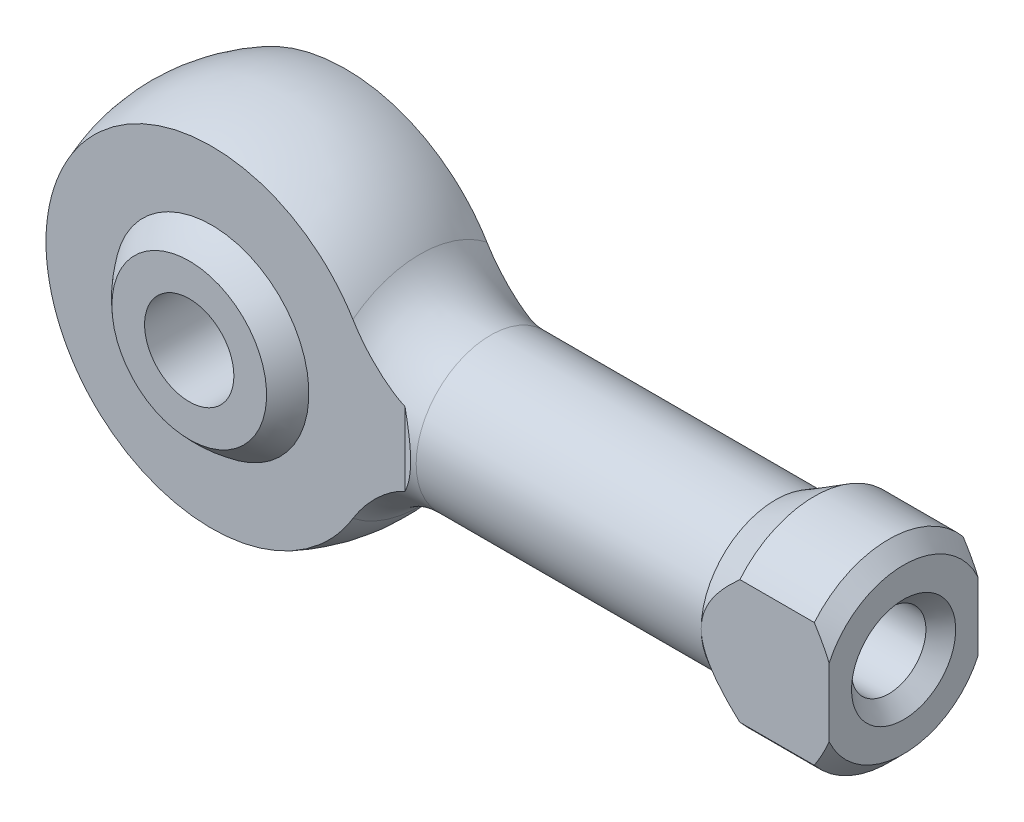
ISO-10303-21;
HEADER;
FILE_DESCRIPTION(('STEP AP214'),'2;1');
FILE_NAME('part.step','',(''),(''),'','','');
FILE_SCHEMA(('AUTOMOTIVE_DESIGN { 1 0 10303 214 1 1 1 1 }'));
ENDSEC;
DATA;
#1=APPLICATION_CONTEXT('core data for automotive mechanical design processes');
#2=APPLICATION_PROTOCOL_DEFINITION('international standard','automotive_design',2000,#1);
#3=PRODUCT_CONTEXT('',#1,'mechanical');
#4=PRODUCT('Part','Part','',(#3));
#5=PRODUCT_RELATED_PRODUCT_CATEGORY('part','',(#4));
#6=PRODUCT_DEFINITION_FORMATION('','',#4);
#7=PRODUCT_DEFINITION_CONTEXT('part definition',#1,'design');
#8=PRODUCT_DEFINITION('design','',#6,#7);
#9=PRODUCT_DEFINITION_SHAPE('','',#8);
#10=(LENGTH_UNIT() NAMED_UNIT(*) SI_UNIT(.MILLI.,.METRE.));
#11=(NAMED_UNIT(*) PLANE_ANGLE_UNIT() SI_UNIT($,.RADIAN.));
#12=(NAMED_UNIT(*) SI_UNIT($,.STERADIAN.) SOLID_ANGLE_UNIT());
#13=UNCERTAINTY_MEASURE_WITH_UNIT(LENGTH_MEASURE(1.E-05),#10,'distance_accuracy_value','');
#14=(GEOMETRIC_REPRESENTATION_CONTEXT(3) GLOBAL_UNCERTAINTY_ASSIGNED_CONTEXT((#13)) GLOBAL_UNIT_ASSIGNED_CONTEXT((#10,
#11,#12)) REPRESENTATION_CONTEXT('',''));
#15=CARTESIAN_POINT('',(0.,0.,0.));
#16=DIRECTION('',(0.,0.,1.));
#17=DIRECTION('',(1.,0.,0.));
#18=AXIS2_PLACEMENT_3D('',#15,#16,#17);
#19=CARTESIAN_POINT('',(0.,0.,0.));
#20=DIRECTION('',(-1.,0.,0.));
#21=DIRECTION('',(0.,0.,1.));
#22=AXIS2_PLACEMENT_3D('',#19,#20,#21);
#23=CYLINDRICAL_SURFACE('',#22,3.25);
#24=CARTESIAN_POINT('',(20.5,0.,0.));
#25=DIRECTION('',(-1.,0.,0.));
#26=DIRECTION('',(0.,0.,1.));
#27=AXIS2_PLACEMENT_3D('',#24,#25,#26);
#28=CIRCLE('',#27,3.25);
#29=CARTESIAN_POINT('',(20.5,2.07665596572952,2.5));
#30=VERTEX_POINT('',#29);
#31=CARTESIAN_POINT('',(20.5,2.0766559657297,-2.5));
#32=VERTEX_POINT('',#31);
#33=EDGE_CURVE('E149',#30,#32,#28,.T.);
#34=ORIENTED_EDGE('',*,*,#33,.T.);
#35=DIRECTION('',(-1.,0.,0.));
#36=VECTOR('',#35,1.);
#37=CARTESIAN_POINT('',(0.,2.07665596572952,-2.5));
#38=LINE('',#37,#36);
#39=CARTESIAN_POINT('',(18.,2.07665596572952,-2.5));
#40=VERTEX_POINT('',#39);
#41=EDGE_CURVE('E223',#32,#40,#38,.T.);
#42=ORIENTED_EDGE('',*,*,#41,.T.);
#43=CARTESIAN_POINT('',(18.,0.,0.));
#44=DIRECTION('',(-1.,0.,0.));
#45=DIRECTION('',(0.,0.,1.));
#46=AXIS2_PLACEMENT_3D('',#43,#44,#45);
#47=CIRCLE('',#46,3.25);
#48=CARTESIAN_POINT('',(18.,2.07665596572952,2.5));
#49=VERTEX_POINT('',#48);
#50=EDGE_CURVE('E156',#49,#40,#47,.T.);
#51=ORIENTED_EDGE('',*,*,#50,.F.);
#52=DIRECTION('',(-1.,0.,0.));
#53=VECTOR('',#52,1.);
#54=CARTESIAN_POINT('',(0.,2.07665596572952,2.5));
#55=LINE('',#54,#53);
#56=EDGE_CURVE('E140',#49,#30,#55,.F.);
#57=ORIENTED_EDGE('',*,*,#56,.T.);
#58=EDGE_LOOP('',(#34,#42,#51,#57));
#59=FACE_BOUND('',#58,.T.);
#60=ADVANCED_FACE('F35',(#59),#23,.T.);
#61=CARTESIAN_POINT('',(18.,0.,0.));
#62=DIRECTION('',(1.,0.,0.));
#63=DIRECTION('',(0.,0.,-1.));
#64=AXIS2_PLACEMENT_3D('',#61,#62,#63);
#65=CONICAL_SURFACE('',#64,3.25,0.523598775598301);
#66=ORIENTED_EDGE('',*,*,#50,.T.);
#67=CARTESIAN_POINT('',(21.1661817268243,-4.41995951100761,-2.5));
#68=CARTESIAN_POINT('',(21.0242948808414,-4.32582987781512,-2.5));
#69=CARTESIAN_POINT('',(20.882727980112,-4.23121317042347,-2.5));
#70=CARTESIAN_POINT('',(20.600397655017,-4.04075445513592,-2.5));
#71=CARTESIAN_POINT('',(20.4596343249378,-3.94491230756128,-2.5));
#72=CARTESIAN_POINT('',(20.1784463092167,-3.75131791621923,-2.5));
#73=CARTESIAN_POINT('',(20.0380263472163,-3.65355879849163,-2.5));
#74=CARTESIAN_POINT('',(19.7584673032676,-3.45624013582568,-2.5));
#75=CARTESIAN_POINT('',(19.6193281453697,-3.35668069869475,-2.5));
#76=CARTESIAN_POINT('',(19.3348943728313,-3.14964171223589,-2.5));
#77=CARTESIAN_POINT('',(19.189694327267,-3.04203186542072,-2.5));
#78=CARTESIAN_POINT('',(18.9017454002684,-2.82358428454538,-2.5));
#79=CARTESIAN_POINT('',(18.7589963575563,-2.71274676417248,-2.5));
#80=CARTESIAN_POINT('',(18.4771831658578,-2.4870216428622,-2.5));
#81=CARTESIAN_POINT('',(18.3381123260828,-2.37214242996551,-2.5));
#82=CARTESIAN_POINT('',(18.0649356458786,-2.13665422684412,-2.5));
#83=CARTESIAN_POINT('',(17.9308276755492,-2.01604774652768,-2.5));
#84=CARTESIAN_POINT('',(17.730256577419,-1.82409334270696,-2.5));
#85=CARTESIAN_POINT('',(17.6610579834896,-1.75561114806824,-2.5));
#86=CARTESIAN_POINT('',(17.5255986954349,-1.6157264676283,-2.5));
#87=CARTESIAN_POINT('',(17.4593391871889,-1.54432282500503,-2.5));
#88=CARTESIAN_POINT('',(17.3311786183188,-1.39842801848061,-2.5));
#89=CARTESIAN_POINT('',(17.269253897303,-1.32395783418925,-2.5));
#90=CARTESIAN_POINT('',(17.1508496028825,-1.17084208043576,-2.5));
#91=CARTESIAN_POINT('',(17.0943661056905,-1.09219958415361,-2.5));
#92=CARTESIAN_POINT('',(16.9858307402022,-0.925071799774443,-2.5));
#93=CARTESIAN_POINT('',(16.9342420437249,-0.836279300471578,-2.5));
#94=CARTESIAN_POINT('',(16.8434382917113,-0.652510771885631,-2.5));
#95=CARTESIAN_POINT('',(16.8042051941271,-0.557544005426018,-2.5));
#96=CARTESIAN_POINT('',(16.7480866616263,-0.378379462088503,-2.5));
#97=CARTESIAN_POINT('',(16.7285639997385,-0.29503029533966,-2.5));
#98=CARTESIAN_POINT('',(16.7040440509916,-0.126241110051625,-2.5));
#99=CARTESIAN_POINT('',(16.6990275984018,-0.040804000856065,-2.5));
#100=CARTESIAN_POINT('',(16.7042637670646,0.129665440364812,-2.5));
#101=CARTESIAN_POINT('',(16.7145322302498,0.214697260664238,-2.5));
#102=CARTESIAN_POINT('',(16.7488237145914,0.381907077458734,-2.5));
#103=CARTESIAN_POINT('',(16.7728576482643,0.46408275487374,-2.5));
#104=CARTESIAN_POINT('',(16.8251358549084,0.606025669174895,-2.5));
#105=CARTESIAN_POINT('',(16.8511771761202,0.666636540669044,-2.5));
#106=CARTESIAN_POINT('',(16.9085163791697,0.785345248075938,-2.5));
#107=CARTESIAN_POINT('',(16.9398176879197,0.84344141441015,-2.5));
#108=CARTESIAN_POINT('',(17.006935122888,0.957813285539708,-2.5));
#109=CARTESIAN_POINT('',(17.0427979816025,1.01406123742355,-2.5));
#110=CARTESIAN_POINT('',(17.1178408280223,1.1242385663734,-2.5));
#111=CARTESIAN_POINT('',(17.1570192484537,1.17816902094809,-2.5));
#112=CARTESIAN_POINT('',(17.2826881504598,1.34243583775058,-2.5));
#113=CARTESIAN_POINT('',(17.3736699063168,1.44932908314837,-2.5));
#114=CARTESIAN_POINT('',(17.5629825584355,1.65645435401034,-2.5));
#115=CARTESIAN_POINT('',(17.6613225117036,1.75667787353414,-2.5));
#116=CARTESIAN_POINT('',(17.8634376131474,1.95254658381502,-2.5));
#117=CARTESIAN_POINT('',(17.9672387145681,2.04816481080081,-2.5));
#118=CARTESIAN_POINT('',(18.1783261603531,2.23547943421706,-2.5));
#119=CARTESIAN_POINT('',(18.2856131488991,2.32717509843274,-2.5));
#120=CARTESIAN_POINT('',(18.4921881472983,2.49874749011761,-2.5));
#121=CARTESIAN_POINT('',(18.5912419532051,2.57890759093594,-2.5));
#122=CARTESIAN_POINT('',(18.7909694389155,2.73720919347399,-2.5));
#123=CARTESIAN_POINT('',(18.8916433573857,2.81535039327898,-2.5));
#124=CARTESIAN_POINT('',(19.093014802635,2.96901770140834,-2.5));
#125=CARTESIAN_POINT('',(19.1936968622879,3.04456413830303,-2.5));
#126=CARTESIAN_POINT('',(19.3960451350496,3.19426868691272,-2.5));
#127=CARTESIAN_POINT('',(19.4977110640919,3.26842718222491,-2.5));
#128=CARTESIAN_POINT('',(19.5997710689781,3.34203124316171,-2.5));
#129=B_SPLINE_CURVE_WITH_KNOTS('',3,(#67,#68,#69,#70,#71,#72,#73,#74,#75,#76,#77,#78,#79,#80,
#81,#82,#83,#84,#85,#86,#87,#88,#89,#90,#91,#92,#93,#94,#95,#96,#97,#98,#99,#100,#101,#102,#103,
#104,#105,#106,#107,#108,#109,#110,#111,#112,#113,#114,#115,#116,#117,#118,#119,#120,#121,#122,
#123,#124,#125,#126,#127,#128),.UNSPECIFIED.,.F.,.F.,(4,2,2,2,2,2,2,2,2,2,2,2,2,2,2,2,2,2,2,2,2,
2,2,2,2,2,2,2,2,2,4),(0.,0.510816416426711,1.02169158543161,1.53497479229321,2.04822736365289,
2.59038108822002,3.13249900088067,3.67355145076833,4.21436894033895,4.50637240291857,
4.79849263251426,5.08886873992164,5.37903385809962,5.68645141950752,5.99341797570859,
6.24914305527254,6.50453011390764,6.76018205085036,7.01603693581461,7.21366467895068,
7.41142168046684,7.61139838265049,7.81128107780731,8.23178303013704,8.6528113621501,
9.07606243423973,9.49939217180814,9.88163773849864,10.2639401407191,10.6415485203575,
11.0190509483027),.UNSPECIFIED.);
#130=CARTESIAN_POINT('',(16.7009618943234,0.,-2.5));
#131=VERTEX_POINT('',#130);
#132=EDGE_CURVE('E221',#40,#131,#129,.F.);
#133=ORIENTED_EDGE('',*,*,#132,.T.);
#134=CARTESIAN_POINT('',(16.7009618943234,0.,0.));
#135=DIRECTION('',(-1.,0.,0.));
#136=DIRECTION('',(0.,0.,1.));
#137=AXIS2_PLACEMENT_3D('',#134,#135,#136);
#138=CIRCLE('',#137,2.5);
#139=CARTESIAN_POINT('',(16.7009618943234,0.,2.5));
#140=VERTEX_POINT('',#139);
#141=EDGE_CURVE('E384',#140,#131,#138,.T.);
#142=ORIENTED_EDGE('',*,*,#141,.F.);
#143=CARTESIAN_POINT('',(21.1661817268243,-4.41995951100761,2.5));
#144=CARTESIAN_POINT('',(21.0242948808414,-4.32582987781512,2.5));
#145=CARTESIAN_POINT('',(20.882727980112,-4.23121317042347,2.5));
#146=CARTESIAN_POINT('',(20.600397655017,-4.04075445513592,2.5));
#147=CARTESIAN_POINT('',(20.4596343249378,-3.94491230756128,2.5));
#148=CARTESIAN_POINT('',(20.1784463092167,-3.75131791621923,2.5));
#149=CARTESIAN_POINT('',(20.0380263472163,-3.65355879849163,2.5));
#150=CARTESIAN_POINT('',(19.7584673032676,-3.45624013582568,2.5));
#151=CARTESIAN_POINT('',(19.6193281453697,-3.35668069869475,2.5));
#152=CARTESIAN_POINT('',(19.3348943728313,-3.14964171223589,2.5));
#153=CARTESIAN_POINT('',(19.189694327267,-3.04203186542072,2.5));
#154=CARTESIAN_POINT('',(18.9017454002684,-2.82358428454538,2.5));
#155=CARTESIAN_POINT('',(18.7589963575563,-2.71274676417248,2.5));
#156=CARTESIAN_POINT('',(18.4771831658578,-2.4870216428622,2.5));
#157=CARTESIAN_POINT('',(18.3381123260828,-2.37214242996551,2.5));
#158=CARTESIAN_POINT('',(18.0649356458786,-2.13665422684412,2.5));
#159=CARTESIAN_POINT('',(17.9308276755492,-2.01604774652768,2.5));
#160=CARTESIAN_POINT('',(17.730256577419,-1.82409334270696,2.5));
#161=CARTESIAN_POINT('',(17.6610579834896,-1.75561114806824,2.5));
#162=CARTESIAN_POINT('',(17.5255986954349,-1.6157264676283,2.5));
#163=CARTESIAN_POINT('',(17.4593391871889,-1.54432282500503,2.5));
#164=CARTESIAN_POINT('',(17.3311786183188,-1.39842801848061,2.5));
#165=CARTESIAN_POINT('',(17.269253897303,-1.32395783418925,2.5));
#166=CARTESIAN_POINT('',(17.1508496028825,-1.17084208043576,2.5));
#167=CARTESIAN_POINT('',(17.0943661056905,-1.09219958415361,2.5));
#168=CARTESIAN_POINT('',(16.9858307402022,-0.925071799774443,2.5));
#169=CARTESIAN_POINT('',(16.9342420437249,-0.836279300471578,2.5));
#170=CARTESIAN_POINT('',(16.8434382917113,-0.652510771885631,2.5));
#171=CARTESIAN_POINT('',(16.8042051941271,-0.557544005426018,2.5));
#172=CARTESIAN_POINT('',(16.7480866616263,-0.378379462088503,2.5));
#173=CARTESIAN_POINT('',(16.7285639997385,-0.29503029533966,2.5));
#174=CARTESIAN_POINT('',(16.7040440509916,-0.126241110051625,2.5));
#175=CARTESIAN_POINT('',(16.6990275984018,-0.040804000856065,2.5));
#176=CARTESIAN_POINT('',(16.7042637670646,0.129665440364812,2.5));
#177=CARTESIAN_POINT('',(16.7145322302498,0.214697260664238,2.5));
#178=CARTESIAN_POINT('',(16.7488237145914,0.381907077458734,2.5));
#179=CARTESIAN_POINT('',(16.7728576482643,0.46408275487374,2.5));
#180=CARTESIAN_POINT('',(16.8251358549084,0.606025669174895,2.5));
#181=CARTESIAN_POINT('',(16.8511771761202,0.666636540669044,2.5));
#182=CARTESIAN_POINT('',(16.9085163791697,0.785345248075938,2.5));
#183=CARTESIAN_POINT('',(16.9398176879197,0.84344141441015,2.5));
#184=CARTESIAN_POINT('',(17.006935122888,0.957813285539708,2.5));
#185=CARTESIAN_POINT('',(17.0427979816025,1.01406123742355,2.5));
#186=CARTESIAN_POINT('',(17.1178408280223,1.1242385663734,2.5));
#187=CARTESIAN_POINT('',(17.1570192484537,1.17816902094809,2.5));
#188=CARTESIAN_POINT('',(17.2826881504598,1.34243583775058,2.5));
#189=CARTESIAN_POINT('',(17.3736699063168,1.44932908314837,2.5));
#190=CARTESIAN_POINT('',(17.5629825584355,1.65645435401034,2.5));
#191=CARTESIAN_POINT('',(17.6613225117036,1.75667787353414,2.5));
#192=CARTESIAN_POINT('',(17.8634376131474,1.95254658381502,2.5));
#193=CARTESIAN_POINT('',(17.9672387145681,2.04816481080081,2.5));
#194=CARTESIAN_POINT('',(18.1783261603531,2.23547943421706,2.5));
#195=CARTESIAN_POINT('',(18.2856131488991,2.32717509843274,2.5));
#196=CARTESIAN_POINT('',(18.4921881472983,2.49874749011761,2.5));
#197=CARTESIAN_POINT('',(18.5912419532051,2.57890759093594,2.5));
#198=CARTESIAN_POINT('',(18.7909694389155,2.73720919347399,2.5));
#199=CARTESIAN_POINT('',(18.8916433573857,2.81535039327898,2.5));
#200=CARTESIAN_POINT('',(19.093014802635,2.96901770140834,2.5));
#201=CARTESIAN_POINT('',(19.1936968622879,3.04456413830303,2.5));
#202=CARTESIAN_POINT('',(19.3960451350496,3.19426868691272,2.5));
#203=CARTESIAN_POINT('',(19.4977110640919,3.26842718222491,2.5));
#204=CARTESIAN_POINT('',(19.5997710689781,3.34203124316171,2.5));
#205=B_SPLINE_CURVE_WITH_KNOTS('',3,(#143,#144,#145,#146,#147,#148,#149,#150,#151,#152,#153,
#154,#155,#156,#157,#158,#159,#160,#161,#162,#163,#164,#165,#166,#167,#168,#169,#170,#171,#172,
#173,#174,#175,#176,#177,#178,#179,#180,#181,#182,#183,#184,#185,#186,#187,#188,#189,#190,#191,
#192,#193,#194,#195,#196,#197,#198,#199,#200,#201,#202,#203,#204),.UNSPECIFIED.,.F.,.F.,(4,2,2,
2,2,2,2,2,2,2,2,2,2,2,2,2,2,2,2,2,2,2,2,2,2,2,2,2,2,2,4),(0.,0.510816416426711,1.02169158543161,
1.53497479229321,2.04822736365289,2.59038108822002,3.13249900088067,3.67355145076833,
4.21436894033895,4.50637240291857,4.79849263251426,5.08886873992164,5.37903385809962,
5.68645141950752,5.99341797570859,6.24914305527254,6.50453011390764,6.76018205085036,
7.01603693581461,7.21366467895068,7.41142168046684,7.61139838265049,7.81128107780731,
8.23178303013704,8.6528113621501,9.07606243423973,9.49939217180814,9.88163773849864,
10.2639401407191,10.6415485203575,11.0190509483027),.UNSPECIFIED.);
#206=EDGE_CURVE('E191',#140,#49,#205,.T.);
#207=ORIENTED_EDGE('',*,*,#206,.T.);
#208=EDGE_LOOP('',(#66,#133,#142,#207));
#209=FACE_BOUND('',#208,.T.);
#210=ADVANCED_FACE('F209',(#209),#65,.T.);
#211=CARTESIAN_POINT('',(20.5,0.,0.));
#212=DIRECTION('',(-1.,0.,0.));
#213=DIRECTION('',(0.,0.,1.));
#214=AXIS2_PLACEMENT_3D('',#211,#212,#213);
#215=CONICAL_SURFACE('',#214,3.25,0.785398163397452);
#216=CARTESIAN_POINT('',(16.5882785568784,6.71120361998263,-2.5));
#217=CARTESIAN_POINT('',(16.7846427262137,6.50159534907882,-2.5));
#218=CARTESIAN_POINT('',(16.9804725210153,6.29147880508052,-2.5));
#219=CARTESIAN_POINT('',(17.3705886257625,5.86971328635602,-2.5));
#220=CARTESIAN_POINT('',(17.5648745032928,5.65806391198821,-2.5));
#221=CARTESIAN_POINT('',(17.9529968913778,5.23098590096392,-2.5));
#222=CARTESIAN_POINT('',(18.1468148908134,5.01554040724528,-2.5));
#223=CARTESIAN_POINT('',(18.5313553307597,4.58195925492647,-2.5));
#224=CARTESIAN_POINT('',(18.7220783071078,4.36382407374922,-2.5));
#225=CARTESIAN_POINT('',(19.0668439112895,3.96116359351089,-2.5));
#226=CARTESIAN_POINT('',(19.221596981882,3.77724789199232,-2.5));
#227=CARTESIAN_POINT('',(19.5266511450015,3.40559005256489,-2.5));
#228=CARTESIAN_POINT('',(19.6769502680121,3.21784628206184,-2.5));
#229=CARTESIAN_POINT('',(19.8970301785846,2.93240351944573,-2.5));
#230=CARTESIAN_POINT('',(19.9694223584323,2.83672025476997,-2.5));
#231=CARTESIAN_POINT('',(20.1119995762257,2.64372685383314,-2.5));
#232=CARTESIAN_POINT('',(20.182184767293,2.54641683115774,-2.5));
#233=CARTESIAN_POINT('',(20.3196889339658,2.349885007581,-2.5));
#234=CARTESIAN_POINT('',(20.3870098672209,2.25066458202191,-2.5));
#235=CARTESIAN_POINT('',(20.5179704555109,2.04983359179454,-2.5));
#236=CARTESIAN_POINT('',(20.5816108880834,1.94822353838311,-2.5));
#237=CARTESIAN_POINT('',(20.6920797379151,1.76219333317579,-2.5));
#238=CARTESIAN_POINT('',(20.7397664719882,1.67828514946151,-2.5));
#239=CARTESIAN_POINT('',(20.8311345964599,1.50828261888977,-2.5));
#240=CARTESIAN_POINT('',(20.8748154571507,1.42218798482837,-2.5));
#241=CARTESIAN_POINT('',(20.9570116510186,1.2476779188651,-2.5));
#242=CARTESIAN_POINT('',(20.9955334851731,1.15926557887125,-2.5));
#243=CARTESIAN_POINT('',(21.066091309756,0.979875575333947,-2.5));
#244=CARTESIAN_POINT('',(21.0981292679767,0.888898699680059,-2.5));
#245=CARTESIAN_POINT('',(21.1480618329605,0.724442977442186,-2.5));
#246=CARTESIAN_POINT('',(21.1675167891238,0.651440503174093,-2.5));
#247=CARTESIAN_POINT('',(21.2006815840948,0.504149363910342,-2.5));
#248=CARTESIAN_POINT('',(21.2143934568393,0.429861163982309,-2.5));
#249=CARTESIAN_POINT('',(21.2353877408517,0.280568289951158,-2.5));
#250=CARTESIAN_POINT('',(21.2426869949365,0.205566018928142,-2.5));
#251=CARTESIAN_POINT('',(21.2505174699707,0.0552050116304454,-2.5));
#252=CARTESIAN_POINT('',(21.2510488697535,-0.0201537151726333,-2.5));
#253=CARTESIAN_POINT('',(21.2453121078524,-0.170643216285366,-2.5));
#254=CARTESIAN_POINT('',(21.239040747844,-0.245773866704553,-2.5));
#255=CARTESIAN_POINT('',(21.2200410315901,-0.395207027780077,-2.5));
#256=CARTESIAN_POINT('',(21.2073121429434,-0.469509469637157,-2.5));
#257=CARTESIAN_POINT('',(21.1759816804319,-0.617082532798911,-2.5));
#258=CARTESIAN_POINT('',(21.1573626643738,-0.690349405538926,-2.5));
#259=CARTESIAN_POINT('',(21.1150345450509,-0.835373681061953,-2.5));
#260=CARTESIAN_POINT('',(21.0913254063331,-0.907131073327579,-2.5));
#261=CARTESIAN_POINT('',(21.0029993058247,-1.149609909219,-2.5));
#262=CARTESIAN_POINT('',(20.9279989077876,-1.31657140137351,-2.5));
#263=CARTESIAN_POINT('',(20.8036140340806,-1.56079453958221,-2.5));
#264=CARTESIAN_POINT('',(20.7601093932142,-1.64126312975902,-2.5));
#265=CARTESIAN_POINT('',(20.6698875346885,-1.80038433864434,-2.5));
#266=CARTESIAN_POINT('',(20.6231707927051,-1.87903722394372,-2.5));
#267=CARTESIAN_POINT('',(20.477983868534,-2.11461497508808,-2.5));
#268=CARTESIAN_POINT('',(20.3755690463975,-2.26909461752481,-2.5));
#269=CARTESIAN_POINT('',(20.1640582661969,-2.57309374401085,-2.5));
#270=CARTESIAN_POINT('',(20.0549692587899,-2.72261814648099,-2.5));
#271=CARTESIAN_POINT('',(19.8116568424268,-3.04528639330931,-2.5));
#272=CARTESIAN_POINT('',(19.6764982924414,-3.21772172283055,-2.5));
#273=CARTESIAN_POINT('',(19.4018015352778,-3.55907942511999,-2.5));
#274=CARTESIAN_POINT('',(19.2622627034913,-3.72800129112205,-2.5));
#275=CARTESIAN_POINT('',(18.9799796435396,-4.06340915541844,-2.5));
#276=CARTESIAN_POINT('',(18.8372325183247,-4.22989270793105,-2.5));
#277=CARTESIAN_POINT('',(18.5494964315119,-4.56091222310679,-2.5));
#278=CARTESIAN_POINT('',(18.404507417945,-4.72544814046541,-2.5));
#279=CARTESIAN_POINT('',(18.1215683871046,-5.04322798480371,-2.5));
#280=CARTESIAN_POINT('',(17.9837158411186,-5.19655885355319,-2.5));
#281=CARTESIAN_POINT('',(17.7068468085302,-5.50217053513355,-2.5));
#282=CARTESIAN_POINT('',(17.5678302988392,-5.65445132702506,-2.5));
#283=CARTESIAN_POINT('',(17.2891444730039,-5.95787345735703,-2.5));
#284=CARTESIAN_POINT('',(17.1494769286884,-6.10901642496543,-2.5));
#285=CARTESIAN_POINT('',(16.8693964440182,-6.41059919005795,-2.5));
#286=CARTESIAN_POINT('',(16.7289835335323,-6.56103901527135,-2.5));
#287=CARTESIAN_POINT('',(16.5882785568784,-6.71120361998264,-2.5));
#288=B_SPLINE_CURVE_WITH_KNOTS('',3,(#216,#217,#218,#219,#220,#221,#222,#223,#224,#225,#226,
#227,#228,#229,#230,#231,#232,#233,#234,#235,#236,#237,#238,#239,#240,#241,#242,#243,#244,#245,
#246,#247,#248,#249,#250,#251,#252,#253,#254,#255,#256,#257,#258,#259,#260,#261,#262,#263,#264,
#265,#266,#267,#268,#269,#270,#271,#272,#273,#274,#275,#276,#277,#278,#279,#280,#281,#282,#283,
#284,#285,#286,#287),.UNSPECIFIED.,.F.,.F.,(4,2,2,2,2,2,2,2,2,2,2,2,2,2,2,2,2,2,2,2,2,2,2,2,2,2,
2,2,2,2,2,2,2,2,2,4),(0.,0.861663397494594,1.72356017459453,2.59293204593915,3.46215176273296,
4.18319428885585,4.90455103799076,5.26447652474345,5.62437698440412,5.98402737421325,
6.34360150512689,6.63305424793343,6.922545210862,7.21166787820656,7.50070266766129,
7.7271560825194,7.95352923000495,8.17930601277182,8.40507682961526,8.63095383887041,
8.85684947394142,9.08342040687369,9.30999291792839,9.85742569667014,10.1318340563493,
10.4062018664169,10.9619266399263,11.5170822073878,12.1742482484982,12.8315084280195,
13.4893880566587,14.1472829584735,14.7658410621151,15.3844114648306,16.001791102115,
16.6191461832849),.UNSPECIFIED.);
#289=CARTESIAN_POINT('',(21.,1.14564392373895,-2.5));
#290=VERTEX_POINT('',#289);
#291=EDGE_CURVE('E161',#32,#290,#288,.T.);
#292=ORIENTED_EDGE('',*,*,#291,.F.);
#293=ORIENTED_EDGE('',*,*,#33,.F.);
#294=CARTESIAN_POINT('',(16.5882785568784,-6.71120361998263,2.5));
#295=CARTESIAN_POINT('',(16.7846427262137,-6.50159534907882,2.5));
#296=CARTESIAN_POINT('',(16.9804725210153,-6.29147880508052,2.5));
#297=CARTESIAN_POINT('',(17.3705886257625,-5.86971328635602,2.5));
#298=CARTESIAN_POINT('',(17.5648745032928,-5.65806391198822,2.5));
#299=CARTESIAN_POINT('',(17.9529968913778,-5.23098590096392,2.5));
#300=CARTESIAN_POINT('',(18.1468148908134,-5.01554040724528,2.5));
#301=CARTESIAN_POINT('',(18.5313553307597,-4.58195925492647,2.5));
#302=CARTESIAN_POINT('',(18.7220783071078,-4.36382407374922,2.5));
#303=CARTESIAN_POINT('',(19.0668439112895,-3.96116359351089,2.5));
#304=CARTESIAN_POINT('',(19.221596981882,-3.77724789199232,2.5));
#305=CARTESIAN_POINT('',(19.5266511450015,-3.40559005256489,2.5));
#306=CARTESIAN_POINT('',(19.6769502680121,-3.21784628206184,2.5));
#307=CARTESIAN_POINT('',(19.8970301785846,-2.93240351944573,2.5));
#308=CARTESIAN_POINT('',(19.9694223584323,-2.83672025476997,2.5));
#309=CARTESIAN_POINT('',(20.1119995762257,-2.64372685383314,2.5));
#310=CARTESIAN_POINT('',(20.182184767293,-2.54641683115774,2.5));
#311=CARTESIAN_POINT('',(20.3196889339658,-2.349885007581,2.5));
#312=CARTESIAN_POINT('',(20.3870098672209,-2.25066458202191,2.5));
#313=CARTESIAN_POINT('',(20.5179704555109,-2.04983359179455,2.5));
#314=CARTESIAN_POINT('',(20.5816108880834,-1.94822353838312,2.5));
#315=CARTESIAN_POINT('',(20.6920797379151,-1.76219333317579,2.5));
#316=CARTESIAN_POINT('',(20.7397664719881,-1.67828514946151,2.5));
#317=CARTESIAN_POINT('',(20.8311345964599,-1.50828261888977,2.5));
#318=CARTESIAN_POINT('',(20.8748154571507,-1.42218798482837,2.5));
#319=CARTESIAN_POINT('',(20.9570116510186,-1.2476779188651,2.5));
#320=CARTESIAN_POINT('',(20.9955334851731,-1.15926557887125,2.5));
#321=CARTESIAN_POINT('',(21.066091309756,-0.979875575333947,2.5));
#322=CARTESIAN_POINT('',(21.0981292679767,-0.888898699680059,2.5));
#323=CARTESIAN_POINT('',(21.1480618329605,-0.724442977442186,2.5));
#324=CARTESIAN_POINT('',(21.1675167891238,-0.651440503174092,2.5));
#325=CARTESIAN_POINT('',(21.2006815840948,-0.504149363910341,2.5));
#326=CARTESIAN_POINT('',(21.2143934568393,-0.429861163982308,2.5));
#327=CARTESIAN_POINT('',(21.2353877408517,-0.280568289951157,2.5));
#328=CARTESIAN_POINT('',(21.2426869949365,-0.205566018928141,2.5));
#329=CARTESIAN_POINT('',(21.2505174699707,-0.0552050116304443,2.5));
#330=CARTESIAN_POINT('',(21.2510488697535,0.0201537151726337,2.5));
#331=CARTESIAN_POINT('',(21.2453121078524,0.170643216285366,2.5));
#332=CARTESIAN_POINT('',(21.239040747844,0.245773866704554,2.5));
#333=CARTESIAN_POINT('',(21.2200410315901,0.395207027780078,2.5));
#334=CARTESIAN_POINT('',(21.2073121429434,0.469509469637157,2.5));
#335=CARTESIAN_POINT('',(21.1759816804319,0.617082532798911,2.5));
#336=CARTESIAN_POINT('',(21.1573626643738,0.690349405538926,2.5));
#337=CARTESIAN_POINT('',(21.1150345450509,0.835373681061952,2.5));
#338=CARTESIAN_POINT('',(21.0913254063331,0.907131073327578,2.5));
#339=CARTESIAN_POINT('',(21.0029993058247,1.149609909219,2.5));
#340=CARTESIAN_POINT('',(20.9279989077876,1.31657140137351,2.5));
#341=CARTESIAN_POINT('',(20.8036140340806,1.5607945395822,2.5));
#342=CARTESIAN_POINT('',(20.7601093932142,1.64126312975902,2.5));
#343=CARTESIAN_POINT('',(20.6698875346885,1.80038433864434,2.5));
#344=CARTESIAN_POINT('',(20.6231707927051,1.87903722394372,2.5));
#345=CARTESIAN_POINT('',(20.477983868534,2.11461497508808,2.5));
#346=CARTESIAN_POINT('',(20.3755690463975,2.26909461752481,2.5));
#347=CARTESIAN_POINT('',(20.1640582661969,2.57309374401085,2.5));
#348=CARTESIAN_POINT('',(20.0549692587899,2.72261814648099,2.5));
#349=CARTESIAN_POINT('',(19.8116568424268,3.04528639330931,2.5));
#350=CARTESIAN_POINT('',(19.6764982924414,3.21772172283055,2.5));
#351=CARTESIAN_POINT('',(19.4018015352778,3.55907942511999,2.5));
#352=CARTESIAN_POINT('',(19.2622627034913,3.72800129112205,2.5));
#353=CARTESIAN_POINT('',(18.9799796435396,4.06340915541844,2.5));
#354=CARTESIAN_POINT('',(18.8372325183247,4.22989270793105,2.5));
#355=CARTESIAN_POINT('',(18.5494964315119,4.56091222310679,2.5));
#356=CARTESIAN_POINT('',(18.404507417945,4.72544814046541,2.5));
#357=CARTESIAN_POINT('',(18.1215683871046,5.0432279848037,2.5));
#358=CARTESIAN_POINT('',(17.9837158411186,5.19655885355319,2.5));
#359=CARTESIAN_POINT('',(17.7068468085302,5.50217053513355,2.5));
#360=CARTESIAN_POINT('',(17.5678302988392,5.65445132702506,2.5));
#361=CARTESIAN_POINT('',(17.2891444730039,5.95787345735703,2.5));
#362=CARTESIAN_POINT('',(17.1494769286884,6.10901642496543,2.5));
#363=CARTESIAN_POINT('',(16.8693964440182,6.41059919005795,2.5));
#364=CARTESIAN_POINT('',(16.7289835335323,6.56103901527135,2.5));
#365=CARTESIAN_POINT('',(16.5882785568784,6.71120361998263,2.5));
#366=B_SPLINE_CURVE_WITH_KNOTS('',3,(#294,#295,#296,#297,#298,#299,#300,#301,#302,#303,#304,
#305,#306,#307,#308,#309,#310,#311,#312,#313,#314,#315,#316,#317,#318,#319,#320,#321,#322,#323,
#324,#325,#326,#327,#328,#329,#330,#331,#332,#333,#334,#335,#336,#337,#338,#339,#340,#341,#342,
#343,#344,#345,#346,#347,#348,#349,#350,#351,#352,#353,#354,#355,#356,#357,#358,#359,#360,#361,
#362,#363,#364,#365),.UNSPECIFIED.,.F.,.F.,(4,2,2,2,2,2,2,2,2,2,2,2,2,2,2,2,2,2,2,2,2,2,2,2,2,2,
2,2,2,2,2,2,2,2,2,4),(0.,0.861663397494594,1.72356017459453,2.59293204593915,3.46215176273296,
4.18319428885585,4.90455103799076,5.26447652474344,5.62437698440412,5.98402737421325,
6.34360150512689,6.63305424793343,6.922545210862,7.21166787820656,7.50070266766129,
7.7271560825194,7.95352923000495,8.17930601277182,8.40507682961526,8.63095383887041,
8.85684947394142,9.08342040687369,9.30999291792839,9.85742569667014,10.1318340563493,
10.4062018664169,10.9619266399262,11.5170822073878,12.1742482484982,12.8315084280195,
13.4893880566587,14.1472829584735,14.7658410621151,15.3844114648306,16.001791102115,
16.6191461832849),.UNSPECIFIED.);
#367=CARTESIAN_POINT('',(21.,1.14564392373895,2.5));
#368=VERTEX_POINT('',#367);
#369=EDGE_CURVE('E137',#368,#30,#366,.T.);
#370=ORIENTED_EDGE('',*,*,#369,.F.);
#371=CARTESIAN_POINT('',(21.,0.,0.));
#372=DIRECTION('',(-1.,0.,0.));
#373=DIRECTION('',(0.,0.,1.));
#374=AXIS2_PLACEMENT_3D('',#371,#372,#373);
#375=CIRCLE('',#374,2.75);
#376=EDGE_CURVE('E398',#290,#368,#375,.F.);
#377=ORIENTED_EDGE('',*,*,#376,.F.);
#378=EDGE_LOOP('',(#292,#293,#370,#377));
#379=FACE_BOUND('',#378,.T.);
#380=ADVANCED_FACE('F160',(#379),#215,.T.);
#381=CARTESIAN_POINT('',(7.12390342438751,0.,0.));
#382=DIRECTION('',(-1.,0.,0.));
#383=DIRECTION('',(0.,0.,1.));
#384=AXIS2_PLACEMENT_3D('',#381,#382,#383);
#385=TOROIDAL_SURFACE('',#384,5.5,3.);
#386=CARTESIAN_POINT('',(6.93321270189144,-0.172605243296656,2.50011547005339));
#387=CARTESIAN_POINT('',(6.92763116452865,-0.224697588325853,2.49689296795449));
#388=CARTESIAN_POINT('',(6.91951904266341,-0.276343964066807,2.49220943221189));
#389=CARTESIAN_POINT('',(6.89884391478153,-0.378286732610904,2.48027264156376));
#390=CARTESIAN_POINT('',(6.88629390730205,-0.428586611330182,2.47302689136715));
#391=CARTESIAN_POINT('',(6.8433353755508,-0.575485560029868,2.44822477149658));
#392=CARTESIAN_POINT('',(6.80737849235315,-0.669936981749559,2.4274650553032));
#393=CARTESIAN_POINT('',(6.74769519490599,-0.802508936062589,2.39300688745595));
#394=CARTESIAN_POINT('',(6.72800657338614,-0.843235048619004,2.38163965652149));
#395=CARTESIAN_POINT('',(6.68685490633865,-0.923484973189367,2.35788073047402));
#396=CARTESIAN_POINT('',(6.665392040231,-0.963008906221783,2.34548913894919));
#397=CARTESIAN_POINT('',(6.62063361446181,-1.04158233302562,2.31964784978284));
#398=CARTESIAN_POINT('',(6.59731346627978,-1.08061293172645,2.3061839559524));
#399=CARTESIAN_POINT('',(6.54942894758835,-1.15761098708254,2.27853781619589));
#400=CARTESIAN_POINT('',(6.52486530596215,-1.19557904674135,2.26435599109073));
#401=CARTESIAN_POINT('',(6.4998,-1.23308767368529,2.24988452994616));
#402=B_SPLINE_CURVE_WITH_KNOTS('',3,(#386,#387,#388,#389,#390,#391,#392,#393,#394,#395,#396,
#397,#398,#399,#400,#401),.UNSPECIFIED.,.F.,.F.,(4,2,2,2,2,2,2,4),(0.,0.157254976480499,
0.314053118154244,0.622117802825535,0.762021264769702,0.901910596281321,1.04413210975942,
1.18627120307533),.UNSPECIFIED.);
#403=CARTESIAN_POINT('',(6.93301270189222,-0.174452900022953,2.5));
#404=VERTEX_POINT('',#403);
#405=CARTESIAN_POINT('',(6.5,-1.23278845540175,2.25));
#406=VERTEX_POINT('',#405);
#407=EDGE_CURVE('E328',#404,#406,#402,.T.);
#408=ORIENTED_EDGE('',*,*,#407,.T.);
#409=CARTESIAN_POINT('',(5.18050464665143,-2.2958538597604,2.25));
#410=CARTESIAN_POINT('',(5.09314909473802,-2.3998632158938,2.25));
#411=CARTESIAN_POINT('',(5.01002503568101,-2.50742867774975,2.25));
#412=CARTESIAN_POINT('',(4.85296343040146,-2.72914491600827,2.25));
#413=CARTESIAN_POINT('',(4.77902940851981,-2.84329819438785,2.25));
#414=CARTESIAN_POINT('',(4.64129666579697,-3.07768213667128,2.25));
#415=CARTESIAN_POINT('',(4.57750472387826,-3.19791679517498,2.25));
#416=CARTESIAN_POINT('',(4.46120124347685,-3.44370560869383,2.25));
#417=CARTESIAN_POINT('',(4.40868573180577,-3.56925787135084,2.25));
#418=CARTESIAN_POINT('',(4.32563365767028,-3.79831802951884,2.25));
#419=CARTESIAN_POINT('',(4.29279759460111,-3.90099597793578,2.25));
#420=CARTESIAN_POINT('',(4.23542209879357,-4.10863845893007,2.25));
#421=CARTESIAN_POINT('',(4.21088108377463,-4.21360255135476,2.25));
#422=CARTESIAN_POINT('',(4.17059793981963,-4.42517291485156,2.25));
#423=CARTESIAN_POINT('',(4.15485249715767,-4.53177855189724,2.25));
#424=CARTESIAN_POINT('',(4.1325968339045,-4.74590675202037,2.25));
#425=CARTESIAN_POINT('',(4.12608212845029,-4.85342884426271,2.25));
#426=CARTESIAN_POINT('',(4.12263493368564,-5.06935914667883,2.25));
#427=CARTESIAN_POINT('',(4.12576710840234,-5.17776845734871,2.25));
#428=CARTESIAN_POINT('',(4.1420380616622,-5.39379237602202,2.25));
#429=CARTESIAN_POINT('',(4.15517219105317,-5.50140732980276,2.25));
#430=CARTESIAN_POINT('',(4.19161873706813,-5.71491914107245,2.25));
#431=CARTESIAN_POINT('',(4.21493220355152,-5.82081582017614,2.25));
#432=CARTESIAN_POINT('',(4.27178682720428,-6.02982616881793,2.25));
#433=CARTESIAN_POINT('',(4.30532666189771,-6.13294019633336,2.25));
#434=CARTESIAN_POINT('',(4.37831137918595,-6.32421776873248,2.25));
#435=CARTESIAN_POINT('',(4.41670801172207,-6.41278231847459,2.25));
#436=CARTESIAN_POINT('',(4.50139174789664,-6.58610143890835,2.25));
#437=CARTESIAN_POINT('',(4.54768166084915,-6.67085463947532,2.25));
#438=CARTESIAN_POINT('',(4.64784772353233,-6.83566221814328,2.25));
#439=CARTESIAN_POINT('',(4.70171706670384,-6.91572072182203,2.25));
#440=CARTESIAN_POINT('',(4.81670896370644,-7.07045792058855,2.25));
#441=CARTESIAN_POINT('',(4.87783396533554,-7.1451347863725,2.25));
#442=CARTESIAN_POINT('',(5.06067750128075,-7.34798665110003,2.25));
#443=CARTESIAN_POINT('',(5.19052007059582,-7.46901755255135,2.25));
#444=CARTESIAN_POINT('',(5.46949096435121,-7.68613199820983,2.25));
#445=CARTESIAN_POINT('',(5.61861301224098,-7.78222363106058,2.25));
#446=CARTESIAN_POINT('',(5.92410751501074,-7.94215381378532,2.25));
#447=CARTESIAN_POINT('',(6.07978113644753,-8.00732681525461,2.25));
#448=CARTESIAN_POINT('',(6.40002845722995,-8.1098509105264,2.25));
#449=CARTESIAN_POINT('',(6.56460067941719,-8.14720660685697,2.25));
#450=CARTESIAN_POINT('',(6.89356583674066,-8.1922665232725,2.25));
#451=CARTESIAN_POINT('',(7.05786113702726,-8.20068612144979,2.25));
#452=CARTESIAN_POINT('',(7.38550063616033,-8.18960459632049,2.25));
#453=CARTESIAN_POINT('',(7.54884489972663,-8.17010539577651,2.25));
#454=CARTESIAN_POINT('',(7.86874729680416,-8.1040634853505,2.25));
#455=CARTESIAN_POINT('',(8.02534541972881,-8.05771402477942,2.25));
#456=CARTESIAN_POINT('',(8.32863316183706,-7.93960402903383,2.25));
#457=CARTESIAN_POINT('',(8.47532267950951,-7.86784323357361,2.25));
#458=CARTESIAN_POINT('',(8.75610603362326,-7.70041404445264,2.25));
#459=CARTESIAN_POINT('',(8.89007702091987,-7.6045398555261,2.25));
#460=CARTESIAN_POINT('',(9.14051211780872,-7.39217409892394,2.25));
#461=CARTESIAN_POINT('',(9.2569747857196,-7.27568083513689,2.25));
#462=CARTESIAN_POINT('',(9.47239167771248,-7.02233802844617,2.25));
#463=CARTESIAN_POINT('',(9.57082447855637,-6.88504562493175,2.25));
#464=CARTESIAN_POINT('',(9.7443737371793,-6.59647131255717,2.25));
#465=CARTESIAN_POINT('',(9.81948683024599,-6.44518738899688,2.25));
#466=CARTESIAN_POINT('',(9.94807796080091,-6.12574302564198,2.25));
#467=CARTESIAN_POINT('',(10.0004272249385,-5.95712913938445,2.25));
#468=CARTESIAN_POINT('',(10.0780956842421,-5.6138186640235,2.25));
#469=CARTESIAN_POINT('',(10.1034074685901,-5.43912042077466,2.25));
#470=CARTESIAN_POINT('',(10.128468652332,-5.07548739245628,2.25));
#471=CARTESIAN_POINT('',(10.1262799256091,-4.88642087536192,2.25));
#472=CARTESIAN_POINT('',(10.0933474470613,-4.51087514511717,2.25));
#473=CARTESIAN_POINT('',(10.0625983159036,-4.32439642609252,2.25));
#474=CARTESIAN_POINT('',(9.97032974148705,-3.93823448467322,2.25));
#475=CARTESIAN_POINT('',(9.90588889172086,-3.73925257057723,2.25));
#476=CARTESIAN_POINT('',(9.74890050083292,-3.35266789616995,2.25));
#477=CARTESIAN_POINT('',(9.65632374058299,-3.16507720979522,2.25));
#478=CARTESIAN_POINT('',(9.43082278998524,-2.77603003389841,2.25));
#479=CARTESIAN_POINT('',(9.2938792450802,-2.57689231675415,2.25));
#480=CARTESIAN_POINT('',(9.06826998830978,-2.29474572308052,2.25));
#481=CARTESIAN_POINT('',(8.98969039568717,-2.2034466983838,2.25));
#482=CARTESIAN_POINT('',(8.82612371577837,-2.02681225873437,2.25));
#483=CARTESIAN_POINT('',(8.74113904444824,-1.94147461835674,2.25));
#484=CARTESIAN_POINT('',(8.55327569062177,-1.76673804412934,2.25));
#485=CARTESIAN_POINT('',(8.4495126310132,-1.67827704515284,2.25));
#486=CARTESIAN_POINT('',(8.28746923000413,-1.55388384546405,2.25));
#487=CARTESIAN_POINT('',(8.23236881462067,-1.51379048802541,2.25));
#488=CARTESIAN_POINT('',(8.11988238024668,-1.43696023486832,2.25));
#489=CARTESIAN_POINT('',(8.06249679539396,-1.40022270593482,2.25));
#490=CARTESIAN_POINT('',(7.91573729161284,-1.31341031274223,2.25));
#491=CARTESIAN_POINT('',(7.82479128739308,-1.26592075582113,2.25));
#492=CARTESIAN_POINT('',(7.63694250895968,-1.18484298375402,2.25));
#493=CARTESIAN_POINT('',(7.54006101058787,-1.15120811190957,2.25));
#494=CARTESIAN_POINT('',(7.36562022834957,-1.10989144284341,2.25));
#495=CARTESIAN_POINT('',(7.28912508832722,-1.09787589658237,2.25));
#496=CARTESIAN_POINT('',(7.13525872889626,-1.08752914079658,2.25));
#497=CARTESIAN_POINT('',(7.05788883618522,-1.08917942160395,2.25));
#498=CARTESIAN_POINT('',(6.90497207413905,-1.10575701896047,2.25));
#499=CARTESIAN_POINT('',(6.82941931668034,-1.12063301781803,2.25));
#500=CARTESIAN_POINT('',(6.68117848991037,-1.16118349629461,2.25));
#501=CARTESIAN_POINT('',(6.60849868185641,-1.18688694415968,2.25));
#502=CARTESIAN_POINT('',(6.46951160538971,-1.2451188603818,2.25));
#503=CARTESIAN_POINT('',(6.40306525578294,-1.27732468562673,2.25));
#504=CARTESIAN_POINT('',(6.2731404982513,-1.34731406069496,2.25));
#505=CARTESIAN_POINT('',(6.20966503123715,-1.38510298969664,2.25));
#506=CARTESIAN_POINT('',(6.08536560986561,-1.46505858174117,2.25));
#507=CARTESIAN_POINT('',(6.02454769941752,-1.50723455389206,2.25));
#508=CARTESIAN_POINT('',(5.90552868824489,-1.59505864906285,2.25));
#509=CARTESIAN_POINT('',(5.84732665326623,-1.64070551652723,2.25));
#510=CARTESIAN_POINT('',(5.67954651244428,-1.77943427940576,2.25));
#511=CARTESIAN_POINT('',(5.57333696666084,-1.87661618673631,2.25));
#512=CARTESIAN_POINT('',(5.37001375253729,-2.07982904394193,2.25));
#513=CARTESIAN_POINT('',(5.27289265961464,-2.18585263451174,2.25));
#514=CARTESIAN_POINT('',(5.18050464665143,-2.2958538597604,2.25));
#515=B_SPLINE_CURVE_WITH_KNOTS('',3,(#409,#410,#411,#412,#413,#414,#415,#416,#417,#418,#419,
#420,#421,#422,#423,#424,#425,#426,#427,#428,#429,#430,#431,#432,#433,#434,#435,#436,#437,#438,
#439,#440,#441,#442,#443,#444,#445,#446,#447,#448,#449,#450,#451,#452,#453,#454,#455,#456,#457,
#458,#459,#460,#461,#462,#463,#464,#465,#466,#467,#468,#469,#470,#471,#472,#473,#474,#475,#476,
#477,#478,#479,#480,#481,#482,#483,#484,#485,#486,#487,#488,#489,#490,#491,#492,#493,#494,#495,
#496,#497,#498,#499,#500,#501,#502,#503,#504,#505,#506,#507,#508,#509,#510,#511,#512,#513,#514),
.UNSPECIFIED.,.T.,.F.,(4,2,2,2,2,2,2,2,2,2,2,2,2,2,2,2,2,2,2,2,2,2,2,2,2,2,2,2,2,2,2,2,2,2,2,2,
2,2,2,2,2,2,2,2,2,2,2,2,2,2,2,2,4),(0.,0.407367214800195,0.814890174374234,1.2226843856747,
1.63033467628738,1.95341999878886,2.2764436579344,2.59934553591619,2.9220904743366,
3.24700350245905,3.57176559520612,3.89656119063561,4.22131480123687,4.51052023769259,
4.79982882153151,5.08887923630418,5.37802744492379,5.90758925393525,6.43697909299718,
6.94078098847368,7.44449950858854,7.9356715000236,8.42680966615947,8.914456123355,
9.40210757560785,9.89407115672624,10.3860752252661,10.8906091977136,11.3952159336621,
11.922584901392,12.4500983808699,13.0149857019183,13.5799794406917,14.2049848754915,
14.8306416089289,15.5527236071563,15.9138529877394,16.2748468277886,16.6832389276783,
16.887571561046,17.0918655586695,17.3989113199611,17.7049144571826,17.9361344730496,
18.1670413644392,18.3970561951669,18.6276903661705,18.8488786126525,19.0702813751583,
19.2921639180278,19.5139665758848,19.9451571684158,20.3759923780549),.UNSPECIFIED.);
#516=CARTESIAN_POINT('',(4.74926894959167,-2.89515879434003,2.25));
#517=VERTEX_POINT('',#516);
#518=EDGE_CURVE('E285',#406,#517,#515,.T.);
#519=ORIENTED_EDGE('',*,*,#518,.T.);
#520=CARTESIAN_POINT('',(4.74926894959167,0.,0.));
#521=DIRECTION('',(-1.,0.,0.));
#522=DIRECTION('',(0.,0.,1.));
#523=AXIS2_PLACEMENT_3D('',#520,#521,#522);
#524=CIRCLE('',#523,3.66666666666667);
#525=CARTESIAN_POINT('',(4.74926894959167,-2.89515879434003,-2.25));
#526=VERTEX_POINT('',#525);
#527=EDGE_CURVE('E394',#526,#517,#524,.T.);
#528=ORIENTED_EDGE('',*,*,#527,.F.);
#529=CARTESIAN_POINT('',(5.18050464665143,-2.2958538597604,-2.25));
#530=CARTESIAN_POINT('',(5.26548078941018,-2.19468091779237,-2.25));
#531=CARTESIAN_POINT('',(5.35443904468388,-2.09689003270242,-2.25));
#532=CARTESIAN_POINT('',(5.53994289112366,-1.90884116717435,-2.25));
#533=CARTESIAN_POINT('',(5.6364854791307,-1.81858023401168,-2.25));
#534=CARTESIAN_POINT('',(5.83689480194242,-1.64728653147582,-2.25));
#535=CARTESIAN_POINT('',(5.94073083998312,-1.56621844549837,-2.25));
#536=CARTESIAN_POINT('',(6.1026452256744,-1.453731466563,-2.25));
#537=CARTESIAN_POINT('',(6.15758831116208,-1.41778482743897,-2.25));
#538=CARTESIAN_POINT('',(6.26972706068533,-1.34961430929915,-2.25));
#539=CARTESIAN_POINT('',(6.32692148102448,-1.31738841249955,-2.25));
#540=CARTESIAN_POINT('',(6.42579548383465,-1.26682631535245,-2.25));
#541=CARTESIAN_POINT('',(6.46684493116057,-1.24726404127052,-2.25));
#542=CARTESIAN_POINT('',(6.55011968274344,-1.21085093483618,-2.25));
#543=CARTESIAN_POINT('',(6.5923449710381,-1.1940000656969,-2.25));
#544=CARTESIAN_POINT('',(6.72045565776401,-1.14843480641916,-2.25));
#545=CARTESIAN_POINT('',(6.80817657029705,-1.12449267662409,-2.25));
#546=CARTESIAN_POINT('',(6.97289279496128,-1.0963131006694,-2.25));
#547=CARTESIAN_POINT('',(7.04945298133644,-1.0896040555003,-2.25));
#548=CARTESIAN_POINT('',(7.20258248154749,-1.08984883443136,-2.25));
#549=CARTESIAN_POINT('',(7.27915178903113,-1.09680749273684,-2.25));
#550=CARTESIAN_POINT('',(7.45005712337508,-1.12658446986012,-2.25));
#551=CARTESIAN_POINT('',(7.5437210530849,-1.1531186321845,-2.25));
#552=CARTESIAN_POINT('',(7.72587361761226,-1.22051235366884,-2.25));
#553=CARTESIAN_POINT('',(7.81433818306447,-1.26143321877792,-2.25));
#554=CARTESIAN_POINT('',(7.98146164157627,-1.35056414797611,-2.25));
#555=CARTESIAN_POINT('',(8.06039146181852,-1.3982796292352,-2.25));
#556=CARTESIAN_POINT('',(8.21405246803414,-1.50011497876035,-2.25));
#557=CARTESIAN_POINT('',(8.2887797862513,-1.55424060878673,-2.25));
#558=CARTESIAN_POINT('',(8.43446499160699,-1.66758603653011,-2.25));
#559=CARTESIAN_POINT('',(8.50541549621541,-1.72681525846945,-2.25));
#560=CARTESIAN_POINT('',(8.64358222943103,-1.84948946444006,-2.25));
#561=CARTESIAN_POINT('',(8.7107974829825,-1.91293553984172,-2.25));
#562=CARTESIAN_POINT('',(8.87361193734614,-2.07563305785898,-2.25));
#563=CARTESIAN_POINT('',(8.9669456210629,-2.1771709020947,-2.25));
#564=CARTESIAN_POINT('',(9.14493589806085,-2.38757938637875,-2.25));
#565=CARTESIAN_POINT('',(9.22958878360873,-2.49645312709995,-2.25));
#566=CARTESIAN_POINT('',(9.46902411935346,-2.83275762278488,-2.25));
#567=CARTESIAN_POINT('',(9.60988240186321,-3.07046999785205,-2.25));
#568=CARTESIAN_POINT('',(9.82412247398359,-3.52279618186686,-2.25));
#569=CARTESIAN_POINT('',(9.9051029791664,-3.73380264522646,-2.25));
#570=CARTESIAN_POINT('',(9.99964977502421,-4.05809756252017,-2.25));
#571=CARTESIAN_POINT('',(10.0266845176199,-4.16754754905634,-2.25));
#572=CARTESIAN_POINT('',(10.0712049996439,-4.38835523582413,-2.25));
#573=CARTESIAN_POINT('',(10.0886946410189,-4.49971213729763,-2.25));
#574=CARTESIAN_POINT('',(10.1137039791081,-4.72437519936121,-2.25));
#575=CARTESIAN_POINT('',(10.1211495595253,-4.83768966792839,-2.25));
#576=CARTESIAN_POINT('',(10.1253904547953,-5.06447279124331,-2.25));
#577=CARTESIAN_POINT('',(10.1221911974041,-5.17794133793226,-2.25));
#578=CARTESIAN_POINT('',(10.1048254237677,-5.40403114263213,-2.25));
#579=CARTESIAN_POINT('',(10.0906602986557,-5.51665250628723,-2.25));
#580=CARTESIAN_POINT('',(10.0511683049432,-5.73991977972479,-2.25));
#581=CARTESIAN_POINT('',(10.0258431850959,-5.85056599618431,-2.25));
#582=CARTESIAN_POINT('',(9.96783491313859,-6.05513743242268,-2.25));
#583=CARTESIAN_POINT('',(9.9364550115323,-6.14943361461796,-2.25));
#584=CARTESIAN_POINT('',(9.86516810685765,-6.33479262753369,-2.25));
#585=CARTESIAN_POINT('',(9.82525808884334,-6.42585430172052,-2.25));
#586=CARTESIAN_POINT('',(9.7371317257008,-6.60377311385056,-2.25));
#587=CARTESIAN_POINT('',(9.68892317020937,-6.69063409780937,-2.25));
#588=CARTESIAN_POINT('',(9.58447369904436,-6.85939444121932,-2.25));
#589=CARTESIAN_POINT('',(9.52823012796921,-6.94129214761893,-2.25));
#590=CARTESIAN_POINT('',(9.35942513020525,-7.16322972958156,-2.25));
#591=CARTESIAN_POINT('',(9.23808672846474,-7.29676228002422,-2.25));
#592=CARTESIAN_POINT('',(8.97362431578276,-7.53998260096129,-2.25));
#593=CARTESIAN_POINT('',(8.830508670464,-7.64967948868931,-2.25));
#594=CARTESIAN_POINT('',(8.53516375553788,-7.83604747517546,-2.25));
#595=CARTESIAN_POINT('',(8.38387454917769,-7.91420811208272,-2.25));
#596=CARTESIAN_POINT('',(8.07004460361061,-8.04312565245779,-2.25));
#597=CARTESIAN_POINT('',(7.90750605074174,-8.09388786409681,-2.25));
#598=CARTESIAN_POINT('',(7.580986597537,-8.16519845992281,-2.25));
#599=CARTESIAN_POINT('',(7.41719089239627,-8.1865969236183,-2.25));
#600=CARTESIAN_POINT('',(7.08835067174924,-8.20125630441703,-2.25));
#601=CARTESIAN_POINT('',(6.92330626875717,-8.1945197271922,-2.25));
#602=CARTESIAN_POINT('',(6.59855235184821,-8.15336325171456,-2.25));
#603=CARTESIAN_POINT('',(6.43880424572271,-8.11924671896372,-2.25));
#604=CARTESIAN_POINT('',(6.12726176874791,-8.02481011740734,-2.25));
#605=CARTESIAN_POINT('',(5.97546735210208,-7.96449019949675,-2.25));
#606=CARTESIAN_POINT('',(5.68321656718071,-7.81917409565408,-2.25));
#607=CARTESIAN_POINT('',(5.5428233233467,-7.73405110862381,-2.25));
#608=CARTESIAN_POINT('',(5.27794351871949,-7.54190670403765,-2.25));
#609=CARTESIAN_POINT('',(5.15345791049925,-7.43488397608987,-2.25));
#610=CARTESIAN_POINT('',(4.92094711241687,-7.19965209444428,-2.25));
#611=CARTESIAN_POINT('',(4.81333244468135,-7.07103760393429,-2.25));
#612=CARTESIAN_POINT('',(4.62025824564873,-6.79815815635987,-2.25));
#613=CARTESIAN_POINT('',(4.53480225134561,-6.65389070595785,-2.25));
#614=CARTESIAN_POINT('',(4.38462386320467,-6.3477139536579,-2.25));
#615=CARTESIAN_POINT('',(4.32087419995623,-6.18532834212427,-2.25));
#616=CARTESIAN_POINT('',(4.21975587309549,-5.8525956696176,-2.25));
#617=CARTESIAN_POINT('',(4.18239014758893,-5.68224772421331,-2.25));
#618=CARTESIAN_POINT('',(4.13227896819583,-5.32686491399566,-2.25));
#619=CARTESIAN_POINT('',(4.12126241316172,-5.14158786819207,-2.25));
#620=CARTESIAN_POINT('',(4.12761520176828,-4.77149239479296,-2.25));
#621=CARTESIAN_POINT('',(4.14500515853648,-4.58667439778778,-2.25));
#622=CARTESIAN_POINT('',(4.20915293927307,-4.20364618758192,-2.25));
#623=CARTESIAN_POINT('',(4.2586152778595,-4.00589280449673,-2.25));
#624=CARTESIAN_POINT('',(4.38583363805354,-3.62007811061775,-2.25));
#625=CARTESIAN_POINT('',(4.46355940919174,-3.43200668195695,-2.25));
#626=CARTESIAN_POINT('',(4.63801713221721,-3.07946853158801,-2.25));
#627=CARTESIAN_POINT('',(4.7332705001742,-2.91426125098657,-2.25));
#628=CARTESIAN_POINT('',(4.94302225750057,-2.59559478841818,-2.25));
#629=CARTESIAN_POINT('',(5.05759822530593,-2.44218674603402,-2.25));
#630=CARTESIAN_POINT('',(5.18050464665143,-2.2958538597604,-2.25));
#631=B_SPLINE_CURVE_WITH_KNOTS('',3,(#529,#530,#531,#532,#533,#534,#535,#536,#537,#538,#539,
#540,#541,#542,#543,#544,#545,#546,#547,#548,#549,#550,#551,#552,#553,#554,#555,#556,#557,#558,
#559,#560,#561,#562,#563,#564,#565,#566,#567,#568,#569,#570,#571,#572,#573,#574,#575,#576,#577,
#578,#579,#580,#581,#582,#583,#584,#585,#586,#587,#588,#589,#590,#591,#592,#593,#594,#595,#596,
#597,#598,#599,#600,#601,#602,#603,#604,#605,#606,#607,#608,#609,#610,#611,#612,#613,#614,#615,
#616,#617,#618,#619,#620,#621,#622,#623,#624,#625,#626,#627,#628,#629,#630),.UNSPECIFIED.,.T.,
.F.,(4,2,2,2,2,2,2,2,2,2,2,2,2,2,2,2,2,2,2,2,2,2,2,2,2,2,2,2,2,2,2,2,2,2,2,2,2,2,2,2,2,2,2,2,2,
2,2,2,2,2,4),(0.,0.3962124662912,0.792268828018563,1.18674803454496,1.38361403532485,
1.58037276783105,1.71669974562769,1.85302487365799,2.1243220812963,2.35373186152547,
2.58322279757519,2.87356098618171,3.16515169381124,3.44145625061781,3.71801107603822,
3.99508800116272,4.27223691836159,4.68544911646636,5.09883707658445,5.92310258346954,
6.59816960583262,6.93602603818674,7.27374425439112,7.6139411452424,7.9539645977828,
8.29394492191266,8.63387199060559,8.93161183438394,9.22945708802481,9.5270242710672,
9.82469002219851,10.3629424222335,10.9009885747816,11.409314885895,11.9175426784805,
12.4107227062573,12.9038588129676,13.391605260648,13.8793488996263,14.3696311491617,
14.8599427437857,15.3607753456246,15.8616878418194,16.3827576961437,16.9038855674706,
17.4583683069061,18.0132535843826,18.622378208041,19.2308527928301,19.801571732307,
20.374639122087),.UNSPECIFIED.);
#632=CARTESIAN_POINT('',(6.5,-1.23278845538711,-2.25));
#633=VERTEX_POINT('',#632);
#634=EDGE_CURVE('E53',#526,#633,#631,.T.);
#635=ORIENTED_EDGE('',*,*,#634,.T.);
#636=CARTESIAN_POINT('',(6.4998,-1.23308767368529,-2.24988452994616));
#637=CARTESIAN_POINT('',(6.53329479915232,-1.18294306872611,-2.26922276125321));
#638=CARTESIAN_POINT('',(6.56591943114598,-1.13196943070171,-2.28805860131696));
#639=CARTESIAN_POINT('',(6.62886908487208,-1.02792437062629,-2.32440260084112));
#640=CARTESIAN_POINT('',(6.65918629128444,-0.974846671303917,-2.34190624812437));
#641=CARTESIAN_POINT('',(6.7160179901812,-0.867827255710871,-2.37471804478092));
#642=CARTESIAN_POINT('',(6.74260845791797,-0.813940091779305,-2.39007005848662));
#643=CARTESIAN_POINT('',(6.79199597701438,-0.70396816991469,-2.41858395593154));
#644=CARTESIAN_POINT('',(6.81479783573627,-0.647886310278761,-2.43174861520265));
#645=CARTESIAN_POINT('',(6.85896540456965,-0.524194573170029,-2.45724877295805));
#646=CARTESIAN_POINT('',(6.87951166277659,-0.456180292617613,-2.46911116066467));
#647=CARTESIAN_POINT('',(6.90441626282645,-0.351769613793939,-2.48348983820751));
#648=CARTESIAN_POINT('',(6.91176229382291,-0.31630948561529,-2.4877310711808));
#649=CARTESIAN_POINT('',(6.92421559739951,-0.244833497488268,-2.49492098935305));
#650=CARTESIAN_POINT('',(6.92932058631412,-0.208817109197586,-2.49786835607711));
#651=CARTESIAN_POINT('',(6.93321270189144,-0.172605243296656,-2.50011547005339));
#652=B_SPLINE_CURVE_WITH_KNOTS('',3,(#636,#637,#638,#639,#640,#641,#642,#643,#644,#645,#646,
#647,#648,#649,#650,#651),.UNSPECIFIED.,.F.,.F.,(4,2,2,2,2,2,2,4),(0.,0.19003289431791,
0.380683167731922,0.566579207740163,0.752237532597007,0.967727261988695,1.07702262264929,
1.18642910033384),.UNSPECIFIED.);
#653=CARTESIAN_POINT('',(6.93301270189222,-0.174452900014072,-2.5));
#654=VERTEX_POINT('',#653);
#655=EDGE_CURVE('E301',#633,#654,#652,.T.);
#656=ORIENTED_EDGE('',*,*,#655,.T.);
#657=CARTESIAN_POINT('',(6.93301270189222,-0.174452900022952,-2.5));
#658=CARTESIAN_POINT('',(6.93301270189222,-0.159938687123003,-2.50101283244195));
#659=CARTESIAN_POINT('',(6.93301270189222,-0.145415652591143,-2.50189924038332));
#660=CARTESIAN_POINT('',(6.93301270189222,-0.116356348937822,-2.50341899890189));
#661=CARTESIAN_POINT('',(6.93301270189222,-0.101820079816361,-2.50405234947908));
#662=CARTESIAN_POINT('',(6.93301270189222,-0.0727387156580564,-2.50506578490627));
#663=CARTESIAN_POINT('',(6.93301270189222,-0.0581936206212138,-2.50544586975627));
#664=CARTESIAN_POINT('',(6.93301270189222,-0.0290990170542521,-2.50595266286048));
#665=CARTESIAN_POINT('',(6.93301270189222,-0.0145495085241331,-2.50607937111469));
#666=CARTESIAN_POINT('',(6.93301270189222,0.0145495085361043,-2.50607937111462));
#667=CARTESIAN_POINT('',(6.93301270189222,0.0290990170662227,-2.50595266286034));
#668=CARTESIAN_POINT('',(6.93301270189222,0.058193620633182,-2.50544586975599));
#669=CARTESIAN_POINT('',(6.93301270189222,0.0727387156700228,-2.50506578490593));
#670=CARTESIAN_POINT('',(6.93301270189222,0.101820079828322,-2.50405234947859));
#671=CARTESIAN_POINT('',(6.93301270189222,0.11635634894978,-2.50341899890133));
#672=CARTESIAN_POINT('',(6.93301270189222,0.145415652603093,-2.50189924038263));
#673=CARTESIAN_POINT('',(6.93301270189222,0.159938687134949,-2.50101283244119));
#674=CARTESIAN_POINT('',(6.93301270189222,0.174452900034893,-2.49999999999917));
#675=B_SPLINE_CURVE_WITH_KNOTS('',3,(#657,#658,#659,#660,#661,#662,#663,#664,#665,#666,#667,
#668,#669,#670,#671,#672,#673,#674),.UNSPECIFIED.,.F.,.F.,(4,2,2,2,2,2,2,2,4),(0.,
0.0436479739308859,0.0872959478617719,0.130943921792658,0.174591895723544,0.21823986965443,
0.261887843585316,0.3055358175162,0.349183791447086),.UNSPECIFIED.);
#676=CARTESIAN_POINT('',(6.93301270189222,0.174452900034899,-2.5));
#677=VERTEX_POINT('',#676);
#678=EDGE_CURVE('E310',#654,#677,#675,.T.);
#679=ORIENTED_EDGE('',*,*,#678,.T.);
#680=CARTESIAN_POINT('',(6.93321270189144,0.17260524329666,-2.50011547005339));
#681=CARTESIAN_POINT('',(6.92763116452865,0.224697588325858,-2.49689296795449));
#682=CARTESIAN_POINT('',(6.9195190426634,0.276343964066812,-2.49220943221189));
#683=CARTESIAN_POINT('',(6.89884391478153,0.378286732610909,-2.48027264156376));
#684=CARTESIAN_POINT('',(6.88629390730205,0.428586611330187,-2.47302689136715));
#685=CARTESIAN_POINT('',(6.8433353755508,0.575485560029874,-2.44822477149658));
#686=CARTESIAN_POINT('',(6.80737849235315,0.669936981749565,-2.42746505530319));
#687=CARTESIAN_POINT('',(6.74769519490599,0.802508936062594,-2.39300688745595));
#688=CARTESIAN_POINT('',(6.72800657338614,0.843235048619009,-2.38163965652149));
#689=CARTESIAN_POINT('',(6.68685490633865,0.923484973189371,-2.35788073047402));
#690=CARTESIAN_POINT('',(6.665392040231,0.963008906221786,-2.34548913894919));
#691=CARTESIAN_POINT('',(6.6206336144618,1.04158233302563,-2.31964784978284));
#692=CARTESIAN_POINT('',(6.59731346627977,1.08061293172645,-2.3061839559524));
#693=CARTESIAN_POINT('',(6.54942894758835,1.15761098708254,-2.27853781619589));
#694=CARTESIAN_POINT('',(6.52486530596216,1.19557904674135,-2.26435599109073));
#695=CARTESIAN_POINT('',(6.4998,1.23308767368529,-2.24988452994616));
#696=B_SPLINE_CURVE_WITH_KNOTS('',3,(#680,#681,#682,#683,#684,#685,#686,#687,#688,#689,#690,
#691,#692,#693,#694,#695),.UNSPECIFIED.,.F.,.F.,(4,2,2,2,2,2,2,4),(0.,0.1572549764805,
0.314053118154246,0.622117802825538,0.762021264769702,0.901910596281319,1.04413210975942,
1.18627120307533),.UNSPECIFIED.);
#697=CARTESIAN_POINT('',(6.5,1.23278845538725,-2.25));
#698=VERTEX_POINT('',#697);
#699=EDGE_CURVE('E311',#677,#698,#696,.T.);
#700=ORIENTED_EDGE('',*,*,#699,.T.);
#701=CARTESIAN_POINT('',(6.20931728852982,1.38634303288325,-2.25));
#702=CARTESIAN_POINT('',(6.11246852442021,1.4454290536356,-2.25));
#703=CARTESIAN_POINT('',(6.01897664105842,1.50999265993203,-2.25));
#704=CARTESIAN_POINT('',(5.83788705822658,1.64700395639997,-2.25));
#705=CARTESIAN_POINT('',(5.7502972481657,1.7194618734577,-2.25));
#706=CARTESIAN_POINT('',(5.58041710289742,1.87099455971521,-2.25));
#707=CARTESIAN_POINT('',(5.49814976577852,1.95009503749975,-2.25));
#708=CARTESIAN_POINT('',(5.33928688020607,2.11384531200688,-2.25));
#709=CARTESIAN_POINT('',(5.26269365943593,2.19849735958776,-2.25));
#710=CARTESIAN_POINT('',(5.11246949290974,2.37639455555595,-2.25));
#711=CARTESIAN_POINT('',(5.03908586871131,2.46984919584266,-2.25));
#712=CARTESIAN_POINT('',(4.89925657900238,2.66182420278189,-2.25));
#713=CARTESIAN_POINT('',(4.83281297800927,2.76034606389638,-2.25));
#714=CARTESIAN_POINT('',(4.64520947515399,3.06236886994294,-2.25));
#715=CARTESIAN_POINT('',(4.53519824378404,3.27300738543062,-2.25));
#716=CARTESIAN_POINT('',(4.35725342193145,3.69454645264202,-2.25));
#717=CARTESIAN_POINT('',(4.28694702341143,3.90443345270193,-2.25));
#718=CARTESIAN_POINT('',(4.20817368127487,4.22579462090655,-2.25));
#719=CARTESIAN_POINT('',(4.18635635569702,4.33409949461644,-2.25));
#720=CARTESIAN_POINT('',(4.15214608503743,4.55216887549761,-2.25));
#721=CARTESIAN_POINT('',(4.1397489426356,4.66193271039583,-2.25));
#722=CARTESIAN_POINT('',(4.12477632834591,4.88286867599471,-2.25));
#723=CARTESIAN_POINT('',(4.12226681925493,4.99404531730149,-2.25));
#724=CARTESIAN_POINT('',(4.12761627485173,5.21610617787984,-2.25));
#725=CARTESIAN_POINT('',(4.1354701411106,5.3269905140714,-2.25));
#726=CARTESIAN_POINT('',(4.16179068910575,5.54746888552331,-2.25));
#727=CARTESIAN_POINT('',(4.18025434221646,5.6570632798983,-2.25));
#728=CARTESIAN_POINT('',(4.22791757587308,5.87389100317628,-2.25));
#729=CARTESIAN_POINT('',(4.25711560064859,5.98112467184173,-2.25));
#730=CARTESIAN_POINT('',(4.32215294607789,6.17966369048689,-2.25));
#731=CARTESIAN_POINT('',(4.35680666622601,6.27135865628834,-2.25));
#732=CARTESIAN_POINT('',(4.43434853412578,6.45124463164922,-2.25));
#733=CARTESIAN_POINT('',(4.47723959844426,6.53943438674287,-2.25));
#734=CARTESIAN_POINT('',(4.57099822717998,6.71138145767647,-2.25));
#735=CARTESIAN_POINT('',(4.62185889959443,6.79514252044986,-2.25));
#736=CARTESIAN_POINT('',(4.73125282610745,6.95750517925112,-2.25));
#737=CARTESIAN_POINT('',(4.78978864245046,7.03610503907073,-2.25));
#738=CARTESIAN_POINT('',(4.96516526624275,7.24937919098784,-2.25));
#739=CARTESIAN_POINT('',(5.09049052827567,7.3772493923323,-2.25));
#740=CARTESIAN_POINT('',(5.36178400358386,7.60862187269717,-2.25));
#741=CARTESIAN_POINT('',(5.5077446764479,7.71213301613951,-2.25));
#742=CARTESIAN_POINT('',(5.8079232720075,7.88649604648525,-2.25));
#743=CARTESIAN_POINT('',(5.96131708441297,7.95876637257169,-2.25));
#744=CARTESIAN_POINT('',(6.2782848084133,8.07569462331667,-2.25));
#745=CARTESIAN_POINT('',(6.44185688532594,8.12035750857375,-2.25));
#746=CARTESIAN_POINT('',(6.76970174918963,8.17972513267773,-2.25));
#747=CARTESIAN_POINT('',(6.93383220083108,8.19521813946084,-2.25));
#748=CARTESIAN_POINT('',(7.26233725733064,8.19814774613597,-2.25));
#749=CARTESIAN_POINT('',(7.42671184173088,8.18558657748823,-2.25));
#750=CARTESIAN_POINT('',(7.7494618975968,8.1330678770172,-2.25));
#751=CARTESIAN_POINT('',(7.90787859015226,8.09336291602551,-2.25));
#752=CARTESIAN_POINT('',(8.21586173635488,7.98809410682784,-2.25));
#753=CARTESIAN_POINT('',(8.36542818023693,7.92253023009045,-2.25));
#754=CARTESIAN_POINT('',(8.65264573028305,7.76707226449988,-2.25));
#755=CARTESIAN_POINT('',(8.79020814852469,7.67701450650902,-2.25));
#756=CARTESIAN_POINT('',(9.04868834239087,7.47556983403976,-2.25));
#757=CARTESIAN_POINT('',(9.16960491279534,7.36418137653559,-2.25));
#758=CARTESIAN_POINT('',(9.39449653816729,7.12059436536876,-2.25));
#759=CARTESIAN_POINT('',(9.49801197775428,6.98797193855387,-2.25));
#760=CARTESIAN_POINT('',(9.68234524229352,6.70782359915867,-2.25));
#761=CARTESIAN_POINT('',(9.76315987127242,6.56029559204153,-2.25));
#762=CARTESIAN_POINT('',(9.90364230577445,6.24795329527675,-2.25));
#763=CARTESIAN_POINT('',(9.96226833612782,6.08267131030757,-2.25));
#764=CARTESIAN_POINT('',(10.0528343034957,5.74498591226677,-2.25));
#765=CARTESIAN_POINT('',(10.0847679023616,5.57258081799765,-2.25));
#766=CARTESIAN_POINT('',(10.123593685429,5.21328356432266,-2.25));
#767=CARTESIAN_POINT('',(10.1286607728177,5.02619586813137,-2.25));
#768=CARTESIAN_POINT('',(10.110313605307,4.65348471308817,-2.25));
#769=CARTESIAN_POINT('',(10.0868915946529,4.46786166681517,-2.25));
#770=CARTESIAN_POINT('',(10.010078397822,4.08337420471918,-2.25));
#771=CARTESIAN_POINT('',(9.95389421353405,3.88507080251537,-2.25));
#772=CARTESIAN_POINT('',(9.81329527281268,3.49878459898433,-2.25));
#773=CARTESIAN_POINT('',(9.72886188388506,3.31080870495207,-2.25));
#774=CARTESIAN_POINT('',(9.52124187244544,2.92105930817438,-2.25));
#775=CARTESIAN_POINT('',(9.39417476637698,2.72134433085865,-2.25));
#776=CARTESIAN_POINT('',(9.18335989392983,2.4370504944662,-2.25));
#777=CARTESIAN_POINT('',(9.10967243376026,2.34478507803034,-2.25));
#778=CARTESIAN_POINT('',(8.95595701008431,2.16568442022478,-2.25));
#779=CARTESIAN_POINT('',(8.8759307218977,2.07884775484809,-2.25));
#780=CARTESIAN_POINT('',(8.73621453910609,1.93786049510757,-2.25));
#781=CARTESIAN_POINT('',(8.67814463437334,1.8820928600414,-2.25));
#782=CARTESIAN_POINT('',(8.55917636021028,1.77366610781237,-2.25));
#783=CARTESIAN_POINT('',(8.49827843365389,1.72100650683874,-2.25));
#784=CARTESIAN_POINT('',(8.37358796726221,1.61926551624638,-2.25));
#785=CARTESIAN_POINT('',(8.30979651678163,1.57018279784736,-2.25));
#786=CARTESIAN_POINT('',(8.17913414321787,1.47633605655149,-2.25));
#787=CARTESIAN_POINT('',(8.11226442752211,1.43157036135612,-2.25));
#788=CARTESIAN_POINT('',(7.95857845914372,1.33733727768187,-2.25));
#789=CARTESIAN_POINT('',(7.87084139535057,1.28934017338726,-2.25));
#790=CARTESIAN_POINT('',(7.68971033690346,1.20561971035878,-2.25));
#791=CARTESIAN_POINT('',(7.59633174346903,1.1698645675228,-2.25));
#792=CARTESIAN_POINT('',(7.42568634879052,1.1222384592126,-2.25));
#793=CARTESIAN_POINT('',(7.34944238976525,1.10682812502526,-2.25));
#794=CARTESIAN_POINT('',(7.19546921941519,1.0894547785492,-2.25));
#795=CARTESIAN_POINT('',(7.11774257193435,1.08747035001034,-2.25));
#796=CARTESIAN_POINT('',(6.96330516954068,1.09729135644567,-2.25));
#797=CARTESIAN_POINT('',(6.88659339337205,1.10908166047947,-2.25));
#798=CARTESIAN_POINT('',(6.73585583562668,1.14432711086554,-2.25));
#799=CARTESIAN_POINT('',(6.66183612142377,1.16780704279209,-2.25));
#800=CARTESIAN_POINT('',(6.52329448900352,1.22123813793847,-2.25));
#801=CARTESIAN_POINT('',(6.45849408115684,1.2504907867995,-2.25));
#802=CARTESIAN_POINT('',(6.33179804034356,1.31456414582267,-2.25));
#803=CARTESIAN_POINT('',(6.26990087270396,1.34938187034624,-2.25));
#804=CARTESIAN_POINT('',(6.20931728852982,1.38634303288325,-2.25));
#805=B_SPLINE_CURVE_WITH_KNOTS('',3,(#701,#702,#703,#704,#705,#706,#707,#708,#709,#710,#711,
#712,#713,#714,#715,#716,#717,#718,#719,#720,#721,#722,#723,#724,#725,#726,#727,#728,#729,#730,
#731,#732,#733,#734,#735,#736,#737,#738,#739,#740,#741,#742,#743,#744,#745,#746,#747,#748,#749,
#750,#751,#752,#753,#754,#755,#756,#757,#758,#759,#760,#761,#762,#763,#764,#765,#766,#767,#768,
#769,#770,#771,#772,#773,#774,#775,#776,#777,#778,#779,#780,#781,#782,#783,#784,#785,#786,#787,
#788,#789,#790,#791,#792,#793,#794,#795,#796,#797,#798,#799,#800,#801,#802,#803,#804),
.UNSPECIFIED.,.T.,.F.,(4,2,2,2,2,2,2,2,2,2,2,2,2,2,2,2,2,2,2,2,2,2,2,2,2,2,2,2,2,2,2,2,2,2,2,2,
2,2,2,2,2,2,2,2,2,2,2,2,2,2,2,4),(0.,0.34024948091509,0.680945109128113,1.02302613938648,
1.36524673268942,1.72139127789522,2.07764146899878,2.78748804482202,3.44853411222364,
3.77962759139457,4.110573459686,4.44372344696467,4.77670959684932,5.10960074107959,
5.44244365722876,5.73612497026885,6.02991045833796,6.32344327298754,6.61707433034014,
7.15121883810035,7.68516866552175,8.19135183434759,8.69744402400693,9.18965188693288,
9.68182060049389,10.1694709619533,10.6571218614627,11.148114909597,11.6391434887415,
12.1415963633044,12.6441199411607,13.167948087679,13.691900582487,14.251028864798,
14.8103093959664,15.4261889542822,16.04247553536,16.7497238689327,17.1037436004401,
17.4576700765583,17.699112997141,17.9405182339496,18.1818333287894,18.4230545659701,
18.7224580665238,19.0210782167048,19.2534331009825,19.4854172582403,19.7171468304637,
19.9493698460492,20.1623262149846,20.3751687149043),.UNSPECIFIED.);
#806=CARTESIAN_POINT('',(4.74926894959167,2.89515879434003,-2.25));
#807=VERTEX_POINT('',#806);
#808=EDGE_CURVE('E270',#698,#807,#805,.T.);
#809=ORIENTED_EDGE('',*,*,#808,.T.);
#810=CARTESIAN_POINT('',(4.74926894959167,2.89515879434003,2.25));
#811=VERTEX_POINT('',#810);
#812=EDGE_CURVE('E395',#811,#807,#524,.T.);
#813=ORIENTED_EDGE('',*,*,#812,.F.);
#814=CARTESIAN_POINT('',(6.20931728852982,1.38634303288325,2.25));
#815=CARTESIAN_POINT('',(6.2924002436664,1.33563539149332,2.25));
#816=CARTESIAN_POINT('',(6.37800660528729,1.28892906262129,2.25));
#817=CARTESIAN_POINT('',(6.55472651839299,1.2071085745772,2.25));
#818=CARTESIAN_POINT('',(6.64583555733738,1.17198506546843,2.25));
#819=CARTESIAN_POINT('',(6.81413371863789,1.12407401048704,2.25));
#820=CARTESIAN_POINT('',(6.89041390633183,1.10820666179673,2.25));
#821=CARTESIAN_POINT('',(7.04448008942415,1.0899101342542,2.25));
#822=CARTESIAN_POINT('',(7.12226208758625,1.0874491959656,2.25));
#823=CARTESIAN_POINT('',(7.27692475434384,1.09637847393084,2.25));
#824=CARTESIAN_POINT('',(7.35380599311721,1.10775939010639,2.25));
#825=CARTESIAN_POINT('',(7.50495987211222,1.14231662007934,2.25));
#826=CARTESIAN_POINT('',(7.57922491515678,1.16552467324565,2.25));
#827=CARTESIAN_POINT('',(7.71556712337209,1.21753235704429,2.25));
#828=CARTESIAN_POINT('',(7.77803972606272,1.24533139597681,2.25));
#829=CARTESIAN_POINT('',(7.90037857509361,1.30622543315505,2.25));
#830=CARTESIAN_POINT('',(7.96024259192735,1.33932485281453,2.25));
#831=CARTESIAN_POINT('',(8.07767578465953,1.40973268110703,2.25));
#832=CARTESIAN_POINT('',(8.13523701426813,1.44705420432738,2.25));
#833=CARTESIAN_POINT('',(8.24806677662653,1.52503111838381,2.25));
#834=CARTESIAN_POINT('',(8.30333444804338,1.56568774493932,2.25));
#835=CARTESIAN_POINT('',(8.46054112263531,1.68765149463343,2.25));
#836=CARTESIAN_POINT('',(8.55967771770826,1.77258768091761,2.25));
#837=CARTESIAN_POINT('',(8.75061201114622,1.95039255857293,2.25));
#838=CARTESIAN_POINT('',(8.84240423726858,2.0432670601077,2.25));
#839=CARTESIAN_POINT('',(9.01839181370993,2.23589596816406,2.25));
#840=CARTESIAN_POINT('',(9.1025899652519,2.33564781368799,2.25));
#841=CARTESIAN_POINT('',(9.26293179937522,2.54150357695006,2.25));
#842=CARTESIAN_POINT('',(9.33907176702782,2.64761038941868,2.25));
#843=CARTESIAN_POINT('',(9.48452544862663,2.8687453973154,2.25));
#844=CARTESIAN_POINT('',(9.55358566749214,2.98394091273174,2.25));
#845=CARTESIAN_POINT('',(9.68133427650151,3.2198756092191,2.25));
#846=CARTESIAN_POINT('',(9.74002866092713,3.34061153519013,2.25));
#847=CARTESIAN_POINT('',(9.84596442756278,3.58680896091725,2.25));
#848=CARTESIAN_POINT('',(9.89322401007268,3.71226257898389,2.25));
#849=CARTESIAN_POINT('',(9.97534742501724,3.96710548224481,2.25));
#850=CARTESIAN_POINT('',(10.0102154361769,4.09649342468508,2.25));
#851=CARTESIAN_POINT('',(10.0813397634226,4.42679088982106,2.25));
#852=CARTESIAN_POINT('',(10.1087758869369,4.62969871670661,2.25));
#853=CARTESIAN_POINT('',(10.1295624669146,5.03729310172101,2.25));
#854=CARTESIAN_POINT('',(10.1229172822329,5.24197942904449,2.25));
#855=CARTESIAN_POINT('',(10.0735546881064,5.64808607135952,2.25));
#856=CARTESIAN_POINT('',(10.0306640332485,5.84948595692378,2.25));
#857=CARTESIAN_POINT('',(9.90815644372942,6.24084271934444,2.25));
#858=CARTESIAN_POINT('',(9.82855427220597,6.43080416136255,2.25));
#859=CARTESIAN_POINT('',(9.64313441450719,6.77504777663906,2.25));
#860=CARTESIAN_POINT('',(9.5404225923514,6.93100492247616,2.25));
#861=CARTESIAN_POINT('',(9.30847991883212,7.22177263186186,2.25));
#862=CARTESIAN_POINT('',(9.17926122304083,7.35659283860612,2.25));
#863=CARTESIAN_POINT('',(8.9078114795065,7.59163457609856,2.25));
#864=CARTESIAN_POINT('',(8.76708548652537,7.69359737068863,2.25));
#865=CARTESIAN_POINT('',(8.4699539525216,7.87130800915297,2.25));
#866=CARTESIAN_POINT('',(8.31355264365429,7.94706290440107,2.25));
#867=CARTESIAN_POINT('',(7.99618202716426,8.06728289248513,2.25));
#868=CARTESIAN_POINT('',(7.83563287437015,8.11285927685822,2.25));
#869=CARTESIAN_POINT('',(7.50910399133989,8.17584934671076,2.25));
#870=CARTESIAN_POINT('',(7.34312494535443,8.19326656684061,2.25));
#871=CARTESIAN_POINT('',(7.01370858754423,8.19930323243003,2.25));
#872=CARTESIAN_POINT('',(6.8502806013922,8.18844586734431,2.25));
#873=CARTESIAN_POINT('',(6.52758826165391,8.13939496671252,2.25));
#874=CARTESIAN_POINT('',(6.36832373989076,8.10120253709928,2.25));
#875=CARTESIAN_POINT('',(6.05868054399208,7.99879160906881,2.25));
#876=CARTESIAN_POINT('',(5.90828857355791,7.93461324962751,2.25));
#877=CARTESIAN_POINT('',(5.62021076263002,7.78226092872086,2.25));
#878=CARTESIAN_POINT('',(5.48252535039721,7.69408615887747,2.25));
#879=CARTESIAN_POINT('',(5.22154731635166,7.49502552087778,2.25));
#880=CARTESIAN_POINT('',(5.0984901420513,7.38383129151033,2.25));
#881=CARTESIAN_POINT('',(4.87210559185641,7.14292892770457,2.25));
#882=CARTESIAN_POINT('',(4.76878044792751,7.01321870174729,2.25));
#883=CARTESIAN_POINT('',(4.581132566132,6.73468098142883,2.25));
#884=CARTESIAN_POINT('',(4.49751818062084,6.58537690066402,2.25));
#885=CARTESIAN_POINT('',(4.3551365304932,6.27539648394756,2.25));
#886=CARTESIAN_POINT('',(4.29637278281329,6.1147185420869,2.25));
#887=CARTESIAN_POINT('',(4.20180725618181,5.7775463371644,2.25));
#888=CARTESIAN_POINT('',(4.16738902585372,5.60066521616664,2.25));
#889=CARTESIAN_POINT('',(4.1263484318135,5.24372097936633,2.25));
#890=CARTESIAN_POINT('',(4.11973801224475,5.06365652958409,2.25));
#891=CARTESIAN_POINT('',(4.13362414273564,4.68982350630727,2.25));
#892=CARTESIAN_POINT('',(4.15638732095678,4.49614161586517,2.25));
#893=CARTESIAN_POINT('',(4.23050087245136,4.11450691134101,2.25));
#894=CARTESIAN_POINT('',(4.28184449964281,3.92655275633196,2.25));
#895=CARTESIAN_POINT('',(4.41782083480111,3.53746595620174,2.25));
#896=CARTESIAN_POINT('',(4.50572555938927,3.33748399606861,2.25));
#897=CARTESIAN_POINT('',(4.70936722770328,2.9516207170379,2.25));
#898=CARTESIAN_POINT('',(4.82518171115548,2.76578061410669,2.25));
#899=CARTESIAN_POINT('',(5.02744583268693,2.48472382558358,2.25));
#900=CARTESIAN_POINT('',(5.10619519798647,2.38384812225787,2.25));
#901=CARTESIAN_POINT('',(5.27117888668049,2.18842567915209,2.25));
#902=CARTESIAN_POINT('',(5.357411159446,2.09387721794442,2.25));
#903=CARTESIAN_POINT('',(5.53666513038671,1.91216381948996,2.25));
#904=CARTESIAN_POINT('',(5.62966007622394,1.82497245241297,2.25));
#905=CARTESIAN_POINT('',(5.82271822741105,1.65890122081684,2.25));
#906=CARTESIAN_POINT('',(5.92277249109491,1.58001114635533,2.25));
#907=CARTESIAN_POINT('',(6.0564493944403,1.48561427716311,2.25));
#908=CARTESIAN_POINT('',(6.08653196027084,1.46504710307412,2.25));
#909=CARTESIAN_POINT('',(6.14739686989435,1.42491296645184,2.25));
#910=CARTESIAN_POINT('',(6.17817986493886,1.40534699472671,2.25));
#911=CARTESIAN_POINT('',(6.20931728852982,1.38634303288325,2.25));
#912=B_SPLINE_CURVE_WITH_KNOTS('',3,(#814,#815,#816,#817,#818,#819,#820,#821,#822,#823,#824,
#825,#826,#827,#828,#829,#830,#831,#832,#833,#834,#835,#836,#837,#838,#839,#840,#841,#842,#843,
#844,#845,#846,#847,#848,#849,#850,#851,#852,#853,#854,#855,#856,#857,#858,#859,#860,#861,#862,
#863,#864,#865,#866,#867,#868,#869,#870,#871,#872,#873,#874,#875,#876,#877,#878,#879,#880,#881,
#882,#883,#884,#885,#886,#887,#888,#889,#890,#891,#892,#893,#894,#895,#896,#897,#898,#899,#900,
#901,#902,#903,#904,#905,#906,#907,#908,#909,#910,#911),.UNSPECIFIED.,.T.,.F.,(4,2,2,2,2,2,2,2,
2,2,2,2,2,2,2,2,2,2,2,2,2,2,2,2,2,2,2,2,2,2,2,2,2,2,2,2,2,2,2,2,2,2,2,2,2,2,2,2,4),(0.,
0.291943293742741,0.583650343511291,0.81639251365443,1.04858308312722,1.2806177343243,
1.51327838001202,1.71811558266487,1.92312455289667,2.12878877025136,2.3345295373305,
2.72559189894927,3.11694297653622,3.50814910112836,3.89953479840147,4.30197323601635,
4.70417818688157,5.10573869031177,5.50716364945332,6.11863525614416,6.73002866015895,
7.34436102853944,7.95844656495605,8.51573169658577,9.07276183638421,9.59150166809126,
10.1101018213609,10.6083495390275,11.1065347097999,11.5955673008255,12.0845801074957,
12.5728404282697,13.0611171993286,13.5564156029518,14.0517699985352,14.5628687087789,
15.0740397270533,15.6123290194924,16.1508494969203,16.7335173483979,17.3160477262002,
17.9689459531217,18.623679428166,19.0072826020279,19.3907809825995,19.7728371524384,
20.1544177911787,20.2637247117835,20.3731377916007),.UNSPECIFIED.);
#913=CARTESIAN_POINT('',(6.5,1.23278845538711,2.25));
#914=VERTEX_POINT('',#913);
#915=EDGE_CURVE('E61',#811,#914,#912,.T.);
#916=ORIENTED_EDGE('',*,*,#915,.T.);
#917=CARTESIAN_POINT('',(6.4998,1.23308767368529,2.24988452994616));
#918=CARTESIAN_POINT('',(6.53329479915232,1.18294306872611,2.26922276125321));
#919=CARTESIAN_POINT('',(6.56591943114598,1.13196943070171,2.28805860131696));
#920=CARTESIAN_POINT('',(6.62886908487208,1.02792437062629,2.32440260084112));
#921=CARTESIAN_POINT('',(6.65918629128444,0.974846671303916,2.34190624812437));
#922=CARTESIAN_POINT('',(6.7160179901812,0.867827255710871,2.37471804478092));
#923=CARTESIAN_POINT('',(6.74260845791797,0.813940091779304,2.39007005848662));
#924=CARTESIAN_POINT('',(6.79199597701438,0.70396816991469,2.41858395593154));
#925=CARTESIAN_POINT('',(6.81479783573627,0.647886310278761,2.43174861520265));
#926=CARTESIAN_POINT('',(6.85896540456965,0.524194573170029,2.45724877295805));
#927=CARTESIAN_POINT('',(6.87951166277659,0.456180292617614,2.46911116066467));
#928=CARTESIAN_POINT('',(6.90441626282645,0.351769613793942,2.48348983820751));
#929=CARTESIAN_POINT('',(6.91176229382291,0.316309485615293,2.4877310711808));
#930=CARTESIAN_POINT('',(6.92421559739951,0.244833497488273,2.49492098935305));
#931=CARTESIAN_POINT('',(6.92932058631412,0.20881710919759,2.49786835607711));
#932=CARTESIAN_POINT('',(6.93321270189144,0.172605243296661,2.50011547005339));
#933=B_SPLINE_CURVE_WITH_KNOTS('',3,(#917,#918,#919,#920,#921,#922,#923,#924,#925,#926,#927,
#928,#929,#930,#931,#932),.UNSPECIFIED.,.F.,.F.,(4,2,2,2,2,2,2,4),(0.,0.190032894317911,
0.380683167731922,0.566579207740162,0.752237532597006,0.967727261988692,1.07702262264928,
1.18642910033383),.UNSPECIFIED.);
#934=CARTESIAN_POINT('',(6.93301270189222,0.174452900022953,2.5));
#935=VERTEX_POINT('',#934);
#936=EDGE_CURVE('E321',#914,#935,#933,.T.);
#937=ORIENTED_EDGE('',*,*,#936,.T.);
#938=CARTESIAN_POINT('',(6.93301270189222,0.174452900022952,2.5));
#939=CARTESIAN_POINT('',(6.93301270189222,0.159938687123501,2.50101283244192));
#940=CARTESIAN_POINT('',(6.93301270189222,0.14541565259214,2.50189924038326));
#941=CARTESIAN_POINT('',(6.93301270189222,0.116356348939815,2.50341899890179));
#942=CARTESIAN_POINT('',(6.93301270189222,0.101820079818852,2.50405234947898));
#943=CARTESIAN_POINT('',(6.93301270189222,0.0727387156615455,2.50506578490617));
#944=CARTESIAN_POINT('',(6.93301270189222,0.0581936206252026,2.50544586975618));
#945=CARTESIAN_POINT('',(6.93301270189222,0.0290990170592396,2.50595266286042));
#946=CARTESIAN_POINT('',(6.93301270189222,0.0145495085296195,2.50607937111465));
#947=CARTESIAN_POINT('',(6.93301270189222,-0.0145495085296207,2.50607937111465));
#948=CARTESIAN_POINT('',(6.93301270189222,-0.0290990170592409,2.50595266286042));
#949=CARTESIAN_POINT('',(6.93301270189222,-0.0581936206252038,2.50544586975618));
#950=CARTESIAN_POINT('',(6.93301270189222,-0.0727387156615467,2.50506578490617));
#951=CARTESIAN_POINT('',(6.93301270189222,-0.101820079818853,2.50405234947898));
#952=CARTESIAN_POINT('',(6.93301270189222,-0.116356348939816,2.50341899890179));
#953=CARTESIAN_POINT('',(6.93301270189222,-0.145415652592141,2.50189924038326));
#954=CARTESIAN_POINT('',(6.93301270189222,-0.159938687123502,2.50101283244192));
#955=CARTESIAN_POINT('',(6.93301270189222,-0.174452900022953,2.5));
#956=B_SPLINE_CURVE_WITH_KNOTS('',3,(#938,#939,#940,#941,#942,#943,#944,#945,#946,#947,#948,
#949,#950,#951,#952,#953,#954,#955),.UNSPECIFIED.,.F.,.F.,(4,2,2,2,2,2,2,2,4),(0.,
0.043647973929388,0.0872959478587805,0.130943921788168,0.174591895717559,0.218239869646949,
0.261887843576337,0.305535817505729,0.349183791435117),.UNSPECIFIED.);
#957=EDGE_CURVE('E309',#935,#404,#956,.T.);
#958=ORIENTED_EDGE('',*,*,#957,.T.);
#959=EDGE_LOOP('',(#408,#519,#528,#635,#656,#679,#700,#809,#813,#916,#937,#958));
#960=FACE_BOUND('',#959,.T.);
#961=CARTESIAN_POINT('',(7.12390342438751,0.,0.));
#962=DIRECTION('',(-1.,0.,0.));
#963=DIRECTION('',(0.,0.,1.));
#964=AXIS2_PLACEMENT_3D('',#961,#962,#963);
#965=CIRCLE('',#964,2.5);
#966=CARTESIAN_POINT('',(7.12390342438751,0.,2.5));
#967=VERTEX_POINT('',#966);
#968=EDGE_CURVE('E422',#967,#967,#965,.T.);
#969=ORIENTED_EDGE('',*,*,#968,.T.);
#970=EDGE_LOOP('',(#969));
#971=FACE_BOUND('',#970,.T.);
#972=ADVANCED_FACE('F260',(#960,#971),#385,.F.);
#973=CARTESIAN_POINT('',(0.,0.,0.));
#974=DIRECTION('',(-1.,0.,0.));
#975=DIRECTION('',(0.,1.,0.));
#976=AXIS2_PLACEMENT_3D('',#973,#974,#975);
#977=SPHERICAL_SURFACE('',#976,6.);
#978=ORIENTED_EDGE('',*,*,#527,.T.);
#979=CARTESIAN_POINT('',(0.,0.,2.25));
#980=DIRECTION('',(0.,0.,-1.));
#981=DIRECTION('',(-1.,0.,0.));
#982=AXIS2_PLACEMENT_3D('',#979,#980,#981);
#983=CIRCLE('',#982,5.56214886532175);
#984=EDGE_CURVE('E314',#517,#811,#983,.T.);
#985=ORIENTED_EDGE('',*,*,#984,.T.);
#986=ORIENTED_EDGE('',*,*,#812,.T.);
#987=CARTESIAN_POINT('',(0.,0.,-2.25));
#988=DIRECTION('',(0.,0.,1.));
#989=DIRECTION('',(1.,0.,0.));
#990=AXIS2_PLACEMENT_3D('',#987,#988,#989);
#991=CIRCLE('',#990,5.56214886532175);
#992=EDGE_CURVE('E452',#807,#526,#991,.T.);
#993=ORIENTED_EDGE('',*,*,#992,.T.);
#994=EDGE_LOOP('',(#978,#985,#986,#993));
#995=FACE_BOUND('',#994,.T.);
#996=ADVANCED_FACE('F264',(#995),#977,.T.);
#997=CARTESIAN_POINT('',(12.278312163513,0.,0.));
#998=DIRECTION('',(1.,0.,0.));
#999=DIRECTION('',(0.,0.,-1.));
#1000=AXIS2_PLACEMENT_3D('',#997,#998,#999);
#1001=CONICAL_SURFACE('',#1000,0.,1.04719755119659);
#1002=CARTESIAN_POINT('',(13.,0.,0.));
#1003=DIRECTION('',(-1.,0.,0.));
#1004=DIRECTION('',(0.,0.,1.));
#1005=AXIS2_PLACEMENT_3D('',#1002,#1003,#1004);
#1006=CIRCLE('',#1005,1.25);
#1007=CARTESIAN_POINT('',(13.,0.,1.25));
#1008=VERTEX_POINT('',#1007);
#1009=EDGE_CURVE('E386',#1008,#1008,#1006,.T.);
#1010=ORIENTED_EDGE('',*,*,#1009,.F.);
#1011=EDGE_LOOP('',(#1010));
#1012=FACE_BOUND('',#1011,.T.);
#1013=CARTESIAN_POINT('',(12.278312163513,0.,0.));
#1014=VERTEX_POINT('',#1013);
#1015=VERTEX_LOOP('',#1014);
#1016=FACE_BOUND('',#1015,.T.);
#1017=ADVANCED_FACE('F583',(#1012,#1016),#1001,.F.);
#1018=CARTESIAN_POINT('',(0.,0.,0.));
#1019=DIRECTION('',(-1.,0.,0.));
#1020=DIRECTION('',(0.,0.,1.));
#1021=AXIS2_PLACEMENT_3D('',#1018,#1019,#1020);
#1022=CYLINDRICAL_SURFACE('',#1021,1.25);
#1023=CARTESIAN_POINT('',(20.5,0.,0.));
#1024=DIRECTION('',(-1.,0.,0.));
#1025=DIRECTION('',(0.,0.,1.));
#1026=AXIS2_PLACEMENT_3D('',#1023,#1024,#1025);
#1027=CIRCLE('',#1026,1.25);
#1028=CARTESIAN_POINT('',(20.5,0.,1.25));
#1029=VERTEX_POINT('',#1028);
#1030=EDGE_CURVE('E165',#1029,#1029,#1027,.F.);
#1031=ORIENTED_EDGE('',*,*,#1030,.T.);
#1032=EDGE_LOOP('',(#1031));
#1033=FACE_BOUND('',#1032,.T.);
#1034=ORIENTED_EDGE('',*,*,#1009,.T.);
#1035=EDGE_LOOP('',(#1034));
#1036=FACE_BOUND('',#1035,.T.);
#1037=ADVANCED_FACE('F374',(#1033,#1036),#1022,.F.);
#1038=CARTESIAN_POINT('',(21.,3.25,0.));
#1039=DIRECTION('',(-1.,0.,0.));
#1040=DIRECTION('',(0.,0.,1.));
#1041=AXIS2_PLACEMENT_3D('',#1038,#1039,#1040);
#1042=PLANE('',#1041);
#1043=CARTESIAN_POINT('',(21.,0.,0.));
#1044=DIRECTION('',(-1.,0.,0.));
#1045=DIRECTION('',(0.,0.,1.));
#1046=AXIS2_PLACEMENT_3D('',#1043,#1044,#1045);
#1047=CIRCLE('',#1046,1.74999999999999);
#1048=CARTESIAN_POINT('',(21.,0.,1.74999999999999));
#1049=VERTEX_POINT('',#1048);
#1050=EDGE_CURVE('E401',#1049,#1049,#1047,.T.);
#1051=ORIENTED_EDGE('',*,*,#1050,.T.);
#1052=EDGE_LOOP('',(#1051));
#1053=FACE_BOUND('',#1052,.T.);
#1054=CARTESIAN_POINT('',(21.,-1.14564392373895,2.5));
#1055=VERTEX_POINT('',#1054);
#1056=CARTESIAN_POINT('',(21.,-1.14564392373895,-2.5));
#1057=VERTEX_POINT('',#1056);
#1058=EDGE_CURVE('E399',#1055,#1057,#375,.F.);
#1059=ORIENTED_EDGE('',*,*,#1058,.T.);
#1060=DIRECTION('',(0.,1.,0.));
#1061=VECTOR('',#1060,1.);
#1062=CARTESIAN_POINT('',(21.,3.25,-2.5));
#1063=LINE('',#1062,#1061);
#1064=EDGE_CURVE('E222',#1057,#290,#1063,.T.);
#1065=ORIENTED_EDGE('',*,*,#1064,.T.);
#1066=ORIENTED_EDGE('',*,*,#376,.T.);
#1067=DIRECTION('',(0.,-1.,0.));
#1068=VECTOR('',#1067,1.);
#1069=CARTESIAN_POINT('',(21.,3.25,2.5));
#1070=LINE('',#1069,#1068);
#1071=EDGE_CURVE('E143',#368,#1055,#1070,.T.);
#1072=ORIENTED_EDGE('',*,*,#1071,.T.);
#1073=EDGE_LOOP('',(#1059,#1065,#1066,#1072));
#1074=FACE_BOUND('',#1073,.T.);
#1075=ADVANCED_FACE('F369',(#1053,#1074),#1042,.F.);
#1076=CARTESIAN_POINT('',(18.,-2.07665596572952,-2.5));
#1077=VERTEX_POINT('',#1076);
#1078=CARTESIAN_POINT('',(18.0000000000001,-2.07665596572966,2.5));
#1079=VERTEX_POINT('',#1078);
#1080=EDGE_CURVE('E380',#1077,#1079,#47,.T.);
#1081=ORIENTED_EDGE('',*,*,#1080,.F.);
#1082=DIRECTION('',(-1.,0.,0.));
#1083=VECTOR('',#1082,1.);
#1084=CARTESIAN_POINT('',(0.,-2.07665596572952,-2.5));
#1085=LINE('',#1084,#1083);
#1086=CARTESIAN_POINT('',(20.5,-2.07665596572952,-2.5));
#1087=VERTEX_POINT('',#1086);
#1088=EDGE_CURVE('E381',#1077,#1087,#1085,.F.);
#1089=ORIENTED_EDGE('',*,*,#1088,.T.);
#1090=CARTESIAN_POINT('',(20.5,-2.0766559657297,2.5));
#1091=VERTEX_POINT('',#1090);
#1092=EDGE_CURVE('E162',#1087,#1091,#28,.T.);
#1093=ORIENTED_EDGE('',*,*,#1092,.T.);
#1094=DIRECTION('',(-1.,0.,0.));
#1095=VECTOR('',#1094,1.);
#1096=CARTESIAN_POINT('',(0.,-2.07665596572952,2.5));
#1097=LINE('',#1096,#1095);
#1098=EDGE_CURVE('E199',#1091,#1079,#1097,.T.);
#1099=ORIENTED_EDGE('',*,*,#1098,.T.);
#1100=EDGE_LOOP('',(#1081,#1089,#1093,#1099));
#1101=FACE_BOUND('',#1100,.T.);
#1102=ADVANCED_FACE('F207',(#1101),#23,.T.);
#1103=EDGE_CURVE('E388',#131,#140,#138,.T.);
#1104=ORIENTED_EDGE('',*,*,#1103,.F.);
#1105=EDGE_CURVE('E214',#131,#1077,#129,.F.);
#1106=ORIENTED_EDGE('',*,*,#1105,.T.);
#1107=ORIENTED_EDGE('',*,*,#1080,.T.);
#1108=EDGE_CURVE('E198',#1079,#140,#205,.T.);
#1109=ORIENTED_EDGE('',*,*,#1108,.T.);
#1110=EDGE_LOOP('',(#1104,#1106,#1107,#1109));
#1111=FACE_BOUND('',#1110,.T.);
#1112=ADVANCED_FACE('F201',(#1111),#65,.T.);
#1113=CARTESIAN_POINT('',(0.,0.,0.));
#1114=DIRECTION('',(-1.,0.,0.));
#1115=DIRECTION('',(0.,0.,1.));
#1116=AXIS2_PLACEMENT_3D('',#1113,#1114,#1115);
#1117=CYLINDRICAL_SURFACE('',#1116,2.5);
#1118=ORIENTED_EDGE('',*,*,#968,.F.);
#1119=EDGE_LOOP('',(#1118));
#1120=FACE_BOUND('',#1119,.T.);
#1121=ORIENTED_EDGE('',*,*,#141,.T.);
#1122=ORIENTED_EDGE('',*,*,#1103,.T.);
#1123=EDGE_LOOP('',(#1121,#1122));
#1124=FACE_BOUND('',#1123,.T.);
#1125=ADVANCED_FACE('F206',(#1120,#1124),#1117,.T.);
#1126=CARTESIAN_POINT('',(21.,0.,0.));
#1127=DIRECTION('',(1.,0.,0.));
#1128=DIRECTION('',(0.,0.,-1.));
#1129=AXIS2_PLACEMENT_3D('',#1126,#1127,#1128);
#1130=CONICAL_SURFACE('',#1129,1.74999999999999,0.785398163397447);
#1131=ORIENTED_EDGE('',*,*,#1030,.F.);
#1132=EDGE_LOOP('',(#1131));
#1133=FACE_BOUND('',#1132,.T.);
#1134=ORIENTED_EDGE('',*,*,#1050,.F.);
#1135=EDGE_LOOP('',(#1134));
#1136=FACE_BOUND('',#1135,.T.);
#1137=ADVANCED_FACE('F267',(#1133,#1136),#1130,.F.);
#1138=EDGE_CURVE('E173',#1057,#1087,#288,.T.);
#1139=ORIENTED_EDGE('',*,*,#1138,.F.);
#1140=ORIENTED_EDGE('',*,*,#1058,.F.);
#1141=EDGE_CURVE('E148',#1091,#1055,#366,.T.);
#1142=ORIENTED_EDGE('',*,*,#1141,.F.);
#1143=ORIENTED_EDGE('',*,*,#1092,.F.);
#1144=EDGE_LOOP('',(#1139,#1140,#1142,#1143));
#1145=FACE_BOUND('',#1144,.T.);
#1146=ADVANCED_FACE('F37',(#1145),#215,.T.);
#1147=CARTESIAN_POINT('',(13.6957642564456,-20.,2.5));
#1148=DIRECTION('',(0.,0.,-1.));
#1149=DIRECTION('',(-1.,0.,0.));
#1150=AXIS2_PLACEMENT_3D('',#1147,#1148,#1149);
#1151=PLANE('',#1150);
#1152=ORIENTED_EDGE('',*,*,#1141,.T.);
#1153=ORIENTED_EDGE('',*,*,#1071,.F.);
#1154=ORIENTED_EDGE('',*,*,#369,.T.);
#1155=ORIENTED_EDGE('',*,*,#56,.F.);
#1156=ORIENTED_EDGE('',*,*,#206,.F.);
#1157=ORIENTED_EDGE('',*,*,#1108,.F.);
#1158=ORIENTED_EDGE('',*,*,#1098,.F.);
#1159=EDGE_LOOP('',(#1152,#1153,#1154,#1155,#1156,#1157,#1158));
#1160=FACE_BOUND('',#1159,.T.);
#1161=ADVANCED_FACE('F139',(#1160),#1151,.F.);
#1162=CARTESIAN_POINT('',(13.6957642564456,-20.,-2.5));
#1163=DIRECTION('',(0.,0.,1.));
#1164=DIRECTION('',(1.,0.,0.));
#1165=AXIS2_PLACEMENT_3D('',#1162,#1163,#1164);
#1166=PLANE('',#1165);
#1167=ORIENTED_EDGE('',*,*,#291,.T.);
#1168=ORIENTED_EDGE('',*,*,#1064,.F.);
#1169=ORIENTED_EDGE('',*,*,#1138,.T.);
#1170=ORIENTED_EDGE('',*,*,#1088,.F.);
#1171=ORIENTED_EDGE('',*,*,#1105,.F.);
#1172=ORIENTED_EDGE('',*,*,#132,.F.);
#1173=ORIENTED_EDGE('',*,*,#41,.F.);
#1174=EDGE_LOOP('',(#1167,#1168,#1169,#1170,#1171,#1172,#1173));
#1175=FACE_BOUND('',#1174,.T.);
#1176=ADVANCED_FACE('F183',(#1175),#1166,.F.);
#1177=CARTESIAN_POINT('',(6.5,-20.,-2.25));
#1178=DIRECTION('',(0.500000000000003,0.,0.866025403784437));
#1179=DIRECTION('',(0.866025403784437,0.,-0.500000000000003));
#1180=AXIS2_PLACEMENT_3D('',#1177,#1178,#1179);
#1181=PLANE('',#1180);
#1182=ORIENTED_EDGE('',*,*,#678,.F.);
#1183=ORIENTED_EDGE('',*,*,#655,.F.);
#1184=DIRECTION('',(0.,1.,0.));
#1185=VECTOR('',#1184,1.);
#1186=CARTESIAN_POINT('',(6.5,-20.,-2.25));
#1187=LINE('',#1186,#1185);
#1188=EDGE_CURVE('E157',#633,#698,#1187,.T.);
#1189=ORIENTED_EDGE('',*,*,#1188,.T.);
#1190=ORIENTED_EDGE('',*,*,#699,.F.);
#1191=EDGE_LOOP('',(#1182,#1183,#1189,#1190));
#1192=FACE_BOUND('',#1191,.T.);
#1193=ADVANCED_FACE('F228',(#1192),#1181,.F.);
#1194=CARTESIAN_POINT('',(-6.83903390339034,-20.,-2.25));
#1195=DIRECTION('',(0.,0.,1.));
#1196=DIRECTION('',(1.,0.,0.));
#1197=AXIS2_PLACEMENT_3D('',#1194,#1195,#1196);
#1198=PLANE('',#1197);
#1199=CARTESIAN_POINT('',(0.,0.,-2.25));
#1200=DIRECTION('',(0.,0.,1.));
#1201=DIRECTION('',(1.,0.,0.));
#1202=AXIS2_PLACEMENT_3D('',#1199,#1200,#1201);
#1203=CIRCLE('',#1202,3.26962704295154);
#1204=CARTESIAN_POINT('',(3.26962704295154,0.,-2.25));
#1205=VERTEX_POINT('',#1204);
#1206=EDGE_CURVE('E11',#1205,#1205,#1203,.F.);
#1207=ORIENTED_EDGE('',*,*,#1206,.F.);
#1208=EDGE_LOOP('',(#1207));
#1209=FACE_BOUND('',#1208,.T.);
#1210=ORIENTED_EDGE('',*,*,#992,.F.);
#1211=ORIENTED_EDGE('',*,*,#808,.F.);
#1212=ORIENTED_EDGE('',*,*,#1188,.F.);
#1213=ORIENTED_EDGE('',*,*,#634,.F.);
#1214=EDGE_LOOP('',(#1210,#1211,#1212,#1213));
#1215=FACE_BOUND('',#1214,.T.);
#1216=ADVANCED_FACE('F235',(#1209,#1215),#1198,.F.);
#1217=CARTESIAN_POINT('',(6.5,-20.,2.25));
#1218=DIRECTION('',(0.500000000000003,0.,-0.866025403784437));
#1219=DIRECTION('',(-0.866025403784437,0.,-0.500000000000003));
#1220=AXIS2_PLACEMENT_3D('',#1217,#1218,#1219);
#1221=PLANE('',#1220);
#1222=ORIENTED_EDGE('',*,*,#957,.F.);
#1223=ORIENTED_EDGE('',*,*,#936,.F.);
#1224=DIRECTION('',(0.,1.,0.));
#1225=VECTOR('',#1224,1.);
#1226=CARTESIAN_POINT('',(6.5,-20.,2.25));
#1227=LINE('',#1226,#1225);
#1228=EDGE_CURVE('E337',#406,#914,#1227,.T.);
#1229=ORIENTED_EDGE('',*,*,#1228,.F.);
#1230=ORIENTED_EDGE('',*,*,#407,.F.);
#1231=EDGE_LOOP('',(#1222,#1223,#1229,#1230));
#1232=FACE_BOUND('',#1231,.T.);
#1233=ADVANCED_FACE('F230',(#1232),#1221,.F.);
#1234=CARTESIAN_POINT('',(-6.83903390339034,-20.,2.25));
#1235=DIRECTION('',(0.,0.,-1.));
#1236=DIRECTION('',(-1.,0.,0.));
#1237=AXIS2_PLACEMENT_3D('',#1234,#1235,#1236);
#1238=PLANE('',#1237);
#1239=CARTESIAN_POINT('',(0.,0.,2.25));
#1240=DIRECTION('',(0.,0.,-1.));
#1241=DIRECTION('',(-1.,0.,0.));
#1242=AXIS2_PLACEMENT_3D('',#1239,#1240,#1241);
#1243=CIRCLE('',#1242,3.26962704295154);
#1244=CARTESIAN_POINT('',(-3.26962704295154,0.,2.25));
#1245=VERTEX_POINT('',#1244);
#1246=EDGE_CURVE('E45',#1245,#1245,#1243,.F.);
#1247=ORIENTED_EDGE('',*,*,#1246,.F.);
#1248=EDGE_LOOP('',(#1247));
#1249=FACE_BOUND('',#1248,.T.);
#1250=ORIENTED_EDGE('',*,*,#1228,.T.);
#1251=ORIENTED_EDGE('',*,*,#915,.F.);
#1252=ORIENTED_EDGE('',*,*,#984,.F.);
#1253=ORIENTED_EDGE('',*,*,#518,.F.);
#1254=EDGE_LOOP('',(#1250,#1251,#1252,#1253));
#1255=FACE_BOUND('',#1254,.T.);
#1256=ADVANCED_FACE('F186',(#1249,#1255),#1238,.F.);
#1257=CARTESIAN_POINT('',(0.,0.,0.));
#1258=DIRECTION('',(-1.,0.,0.));
#1259=DIRECTION('',(0.,1.,0.));
#1260=AXIS2_PLACEMENT_3D('',#1257,#1258,#1259);
#1261=SPHERICAL_SURFACE('',#1260,3.969);
#1262=CARTESIAN_POINT('',(0.,0.,0.));
#1263=DIRECTION('',(0.,0.,-1.));
#1264=DIRECTION('',(-1.,0.,0.));
#1265=AXIS2_PLACEMENT_3D('',#1262,#1263,#1264);
#1266=SPHERICAL_SURFACE('',#1265,3.969);
#1267=CARTESIAN_POINT('',(0.,0.,3.));
#1268=DIRECTION('',(0.,0.,-1.));
#1269=DIRECTION('',(-1.,0.,0.));
#1270=AXIS2_PLACEMENT_3D('',#1267,#1268,#1269);
#1271=CIRCLE('',#1270,2.59864599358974);
#1272=CARTESIAN_POINT('',(-2.59864599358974,0.,3.));
#1273=VERTEX_POINT('',#1272);
#1274=EDGE_CURVE('E334',#1273,#1273,#1271,.T.);
#1275=ORIENTED_EDGE('',*,*,#1274,.T.);
#1276=EDGE_LOOP('',(#1275));
#1277=FACE_BOUND('',#1276,.T.);
#1278=ORIENTED_EDGE('',*,*,#1246,.T.);
#1279=EDGE_LOOP('',(#1278));
#1280=FACE_BOUND('',#1279,.T.);
#1281=ADVANCED_FACE('F458',(#1277,#1280),#1266,.T.);
#1282=CARTESIAN_POINT('',(0.,0.,0.));
#1283=DIRECTION('',(0.,0.,1.));
#1284=DIRECTION('',(1.,0.,0.));
#1285=AXIS2_PLACEMENT_3D('',#1282,#1283,#1284);
#1286=SPHERICAL_SURFACE('',#1285,3.969);
#1287=CARTESIAN_POINT('',(0.,0.,-3.));
#1288=DIRECTION('',(0.,0.,1.));
#1289=DIRECTION('',(1.,0.,0.));
#1290=AXIS2_PLACEMENT_3D('',#1287,#1288,#1289);
#1291=CIRCLE('',#1290,2.59864599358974);
#1292=CARTESIAN_POINT('',(2.59864599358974,0.,-3.));
#1293=VERTEX_POINT('',#1292);
#1294=EDGE_CURVE('E332',#1293,#1293,#1291,.T.);
#1295=ORIENTED_EDGE('',*,*,#1294,.T.);
#1296=EDGE_LOOP('',(#1295));
#1297=FACE_BOUND('',#1296,.T.);
#1298=ORIENTED_EDGE('',*,*,#1206,.T.);
#1299=EDGE_LOOP('',(#1298));
#1300=FACE_BOUND('',#1299,.T.);
#1301=ADVANCED_FACE('F184',(#1297,#1300),#1286,.T.);
#1302=CARTESIAN_POINT('',(-5.85013501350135,-20.,-3.));
#1303=DIRECTION('',(0.,0.,1.));
#1304=DIRECTION('',(1.,0.,0.));
#1305=AXIS2_PLACEMENT_3D('',#1302,#1303,#1304);
#1306=PLANE('',#1305);
#1307=CARTESIAN_POINT('',(0.,0.,-3.));
#1308=DIRECTION('',(0.,0.,1.));
#1309=DIRECTION('',(1.,0.,0.));
#1310=AXIS2_PLACEMENT_3D('',#1307,#1308,#1309);
#1311=CIRCLE('',#1310,1.5);
#1312=CARTESIAN_POINT('',(1.5,0.,-3.));
#1313=VERTEX_POINT('',#1312);
#1314=EDGE_CURVE('E335',#1313,#1313,#1311,.T.);
#1315=ORIENTED_EDGE('',*,*,#1314,.T.);
#1316=EDGE_LOOP('',(#1315));
#1317=FACE_BOUND('',#1316,.T.);
#1318=ORIENTED_EDGE('',*,*,#1294,.F.);
#1319=EDGE_LOOP('',(#1318));
#1320=FACE_BOUND('',#1319,.T.);
#1321=ADVANCED_FACE('F361',(#1317,#1320),#1306,.F.);
#1322=CARTESIAN_POINT('',(-5.85013501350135,-20.,3.));
#1323=DIRECTION('',(0.,0.,-1.));
#1324=DIRECTION('',(-1.,0.,0.));
#1325=AXIS2_PLACEMENT_3D('',#1322,#1323,#1324);
#1326=PLANE('',#1325);
#1327=CARTESIAN_POINT('',(0.,0.,3.));
#1328=DIRECTION('',(0.,0.,-1.));
#1329=DIRECTION('',(-1.,0.,0.));
#1330=AXIS2_PLACEMENT_3D('',#1327,#1328,#1329);
#1331=CIRCLE('',#1330,1.5);
#1332=CARTESIAN_POINT('',(1.5,0.,3.));
#1333=VERTEX_POINT('',#1332);
#1334=EDGE_CURVE('E40',#1333,#1333,#1331,.T.);
#1335=ORIENTED_EDGE('',*,*,#1334,.T.);
#1336=EDGE_LOOP('',(#1335));
#1337=FACE_BOUND('',#1336,.T.);
#1338=ORIENTED_EDGE('',*,*,#1274,.F.);
#1339=EDGE_LOOP('',(#1338));
#1340=FACE_BOUND('',#1339,.T.);
#1341=ADVANCED_FACE('F351',(#1337,#1340),#1326,.F.);
#1342=CARTESIAN_POINT('',(0.,0.,-27.));
#1343=DIRECTION('',(0.,0.,1.));
#1344=DIRECTION('',(1.,0.,0.));
#1345=AXIS2_PLACEMENT_3D('',#1342,#1343,#1344);
#1346=CYLINDRICAL_SURFACE('',#1345,1.5);
#1347=CARTESIAN_POINT('',(1.5,0.,3.));
#1348=CARTESIAN_POINT('',(1.5,0.,2.9375));
#1349=CARTESIAN_POINT('',(1.5,0.,2.875));
#1350=CARTESIAN_POINT('',(1.5,0.,2.75));
#1351=CARTESIAN_POINT('',(1.5,0.,2.6875));
#1352=CARTESIAN_POINT('',(1.5,0.,2.5625));
#1353=CARTESIAN_POINT('',(1.5,0.,2.5));
#1354=CARTESIAN_POINT('',(1.5,0.,2.375));
#1355=CARTESIAN_POINT('',(1.5,0.,2.3125));
#1356=CARTESIAN_POINT('',(1.5,0.,2.1875));
#1357=CARTESIAN_POINT('',(1.5,0.,2.125));
#1358=CARTESIAN_POINT('',(1.5,0.,2.));
#1359=CARTESIAN_POINT('',(1.5,0.,1.9375));
#1360=CARTESIAN_POINT('',(1.5,0.,1.8125));
#1361=CARTESIAN_POINT('',(1.5,0.,1.75));
#1362=CARTESIAN_POINT('',(1.5,0.,1.625));
#1363=CARTESIAN_POINT('',(1.5,0.,1.5625));
#1364=CARTESIAN_POINT('',(1.5,0.,1.4375));
#1365=CARTESIAN_POINT('',(1.5,0.,1.375));
#1366=CARTESIAN_POINT('',(1.5,0.,1.25));
#1367=CARTESIAN_POINT('',(1.5,0.,1.1875));
#1368=CARTESIAN_POINT('',(1.5,0.,1.0625));
#1369=CARTESIAN_POINT('',(1.5,0.,1.));
#1370=CARTESIAN_POINT('',(1.5,0.,0.875000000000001));
#1371=CARTESIAN_POINT('',(1.5,0.,0.812500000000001));
#1372=CARTESIAN_POINT('',(1.5,0.,0.687500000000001));
#1373=CARTESIAN_POINT('',(1.5,0.,0.625000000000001));
#1374=CARTESIAN_POINT('',(1.5,0.,0.5));
#1375=CARTESIAN_POINT('',(1.5,0.,0.4375));
#1376=CARTESIAN_POINT('',(1.5,0.,0.3125));
#1377=CARTESIAN_POINT('',(1.5,0.,0.25));
#1378=CARTESIAN_POINT('',(1.5,0.,0.125));
#1379=CARTESIAN_POINT('',(1.5,0.,0.0625));
#1380=CARTESIAN_POINT('',(1.5,0.,-0.0625));
#1381=CARTESIAN_POINT('',(1.5,0.,-0.125));
#1382=CARTESIAN_POINT('',(1.5,0.,-0.25));
#1383=CARTESIAN_POINT('',(1.5,0.,-0.3125));
#1384=CARTESIAN_POINT('',(1.5,0.,-0.4375));
#1385=CARTESIAN_POINT('',(1.5,0.,-0.5));
#1386=CARTESIAN_POINT('',(1.5,0.,-0.625000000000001));
#1387=CARTESIAN_POINT('',(1.5,0.,-0.687500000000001));
#1388=CARTESIAN_POINT('',(1.5,0.,-0.812500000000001));
#1389=CARTESIAN_POINT('',(1.5,0.,-0.875000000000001));
#1390=CARTESIAN_POINT('',(1.5,0.,-1.));
#1391=CARTESIAN_POINT('',(1.5,0.,-1.0625));
#1392=CARTESIAN_POINT('',(1.5,0.,-1.1875));
#1393=CARTESIAN_POINT('',(1.5,0.,-1.25));
#1394=CARTESIAN_POINT('',(1.5,0.,-1.375));
#1395=CARTESIAN_POINT('',(1.5,0.,-1.4375));
#1396=CARTESIAN_POINT('',(1.5,0.,-1.5625));
#1397=CARTESIAN_POINT('',(1.5,0.,-1.625));
#1398=CARTESIAN_POINT('',(1.5,0.,-1.75));
#1399=CARTESIAN_POINT('',(1.5,0.,-1.8125));
#1400=CARTESIAN_POINT('',(1.5,0.,-1.9375));
#1401=CARTESIAN_POINT('',(1.5,0.,-2.));
#1402=CARTESIAN_POINT('',(1.5,0.,-2.125));
#1403=CARTESIAN_POINT('',(1.5,0.,-2.1875));
#1404=CARTESIAN_POINT('',(1.5,0.,-2.3125));
#1405=CARTESIAN_POINT('',(1.5,0.,-2.375));
#1406=CARTESIAN_POINT('',(1.5,0.,-2.5));
#1407=CARTESIAN_POINT('',(1.5,0.,-2.5625));
#1408=CARTESIAN_POINT('',(1.5,0.,-2.6875));
#1409=CARTESIAN_POINT('',(1.5,0.,-2.75));
#1410=CARTESIAN_POINT('',(1.5,0.,-2.875));
#1411=CARTESIAN_POINT('',(1.5,0.,-2.9375));
#1412=CARTESIAN_POINT('',(1.5,0.,-3.));
#1413=B_SPLINE_CURVE_WITH_KNOTS('',3,(#1347,#1348,#1349,#1350,#1351,#1352,#1353,#1354,#1355,
#1356,#1357,#1358,#1359,#1360,#1361,#1362,#1363,#1364,#1365,#1366,#1367,#1368,#1369,#1370,#1371,
#1372,#1373,#1374,#1375,#1376,#1377,#1378,#1379,#1380,#1381,#1382,#1383,#1384,#1385,#1386,#1387,
#1388,#1389,#1390,#1391,#1392,#1393,#1394,#1395,#1396,#1397,#1398,#1399,#1400,#1401,#1402,#1403,
#1404,#1405,#1406,#1407,#1408,#1409,#1410,#1411,#1412),.UNSPECIFIED.,.F.,.F.,(4,2,2,2,2,2,2,2,2,
2,2,2,2,2,2,2,2,2,2,2,2,2,2,2,2,2,2,2,2,2,2,2,4),(0.,0.1875,0.375,0.5625,0.750000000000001,
0.937500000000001,1.125,1.3125,1.5,1.6875,1.875,2.0625,2.25,2.4375,2.625,2.8125,3.,3.1875,3.375,
3.5625,3.75,3.9375,4.125,4.3125,4.5,4.6875,4.875,5.0625,5.25,5.4375,5.625,5.8125,6.),.UNSPECIFIED.);
#1414=EDGE_CURVE('BSEAM354',#1333,#1313,#1413,.T.);
#1415=ORIENTED_EDGE('',*,*,#1334,.F.);
#1416=ORIENTED_EDGE('',*,*,#1314,.F.);
#1417=ORIENTED_EDGE('',*,*,#1414,.T.);
#1418=ORIENTED_EDGE('',*,*,#1414,.F.);
#1419=EDGE_LOOP('',(#1415,#1417,#1416,#1418));
#1420=FACE_BOUND('',#1419,.T.);
#1421=ADVANCED_FACE('F354',(#1420),#1346,.F.);
#1422=CLOSED_SHELL('',(#60,#210,#380,#972,#996,#1017,#1037,#1075,#1102,#1112,#1125,#1137,#1146,
#1161,#1176,#1193,#1216,#1233,#1256,#1281,#1301,#1321,#1341,#1421));
#1423=MANIFOLD_SOLID_BREP('B2',#1422);
#1424=ADVANCED_BREP_SHAPE_REPRESENTATION('',(#18,#1423),#14);
#1425=SHAPE_DEFINITION_REPRESENTATION(#9,#1424);
ENDSEC;
END-ISO-10303-21;
